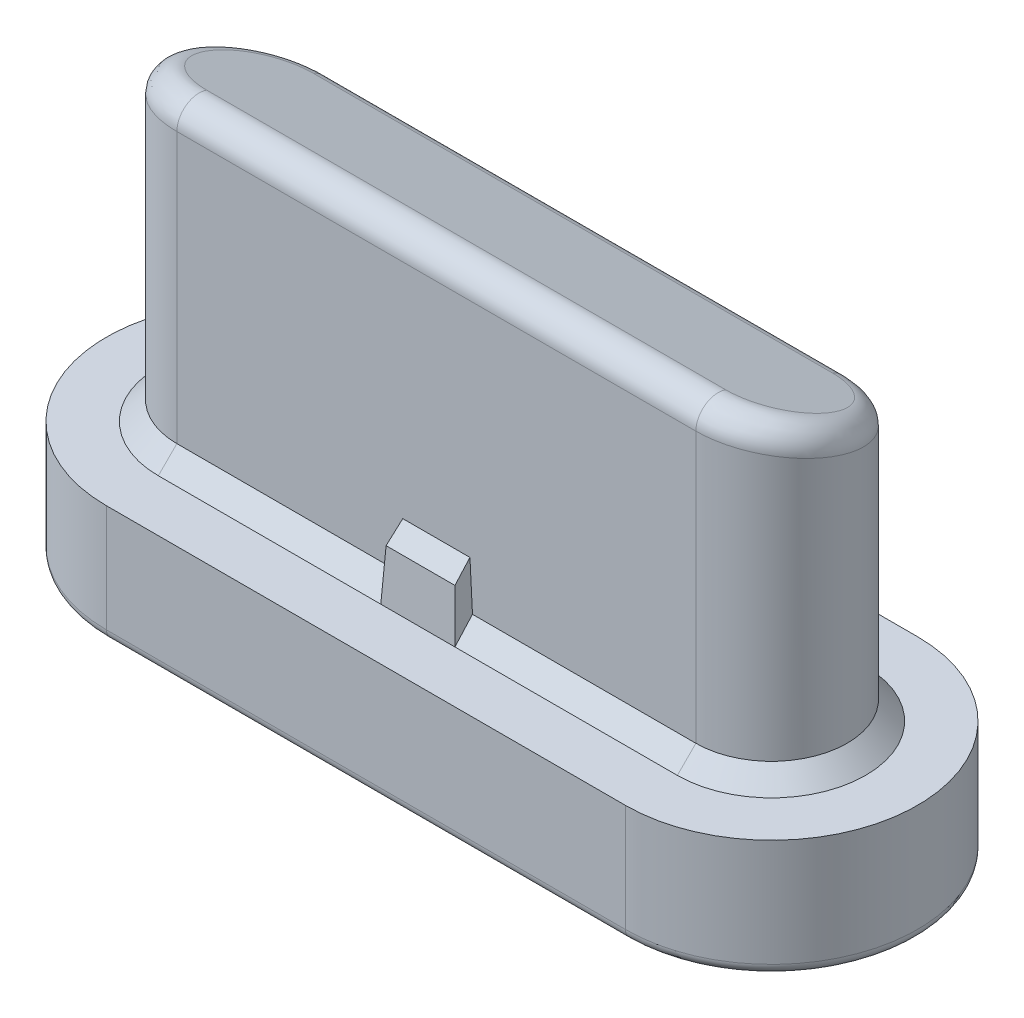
ISO-10303-21;
HEADER;
FILE_DESCRIPTION(('STEP AP214'),'2;1');
FILE_NAME('part.step','',(''),(''),'','','');
FILE_SCHEMA(('AUTOMOTIVE_DESIGN { 1 0 10303 214 1 1 1 1 }'));
ENDSEC;
DATA;
#1=APPLICATION_CONTEXT('core data for automotive mechanical design processes');
#2=APPLICATION_PROTOCOL_DEFINITION('international standard','automotive_design',2000,#1);
#3=PRODUCT_CONTEXT('',#1,'mechanical');
#4=PRODUCT('Part','Part','',(#3));
#5=PRODUCT_RELATED_PRODUCT_CATEGORY('part','',(#4));
#6=PRODUCT_DEFINITION_FORMATION('','',#4);
#7=PRODUCT_DEFINITION_CONTEXT('part definition',#1,'design');
#8=PRODUCT_DEFINITION('design','',#6,#7);
#9=PRODUCT_DEFINITION_SHAPE('','',#8);
#10=(LENGTH_UNIT() NAMED_UNIT(*) SI_UNIT(.MILLI.,.METRE.));
#11=(NAMED_UNIT(*) PLANE_ANGLE_UNIT() SI_UNIT($,.RADIAN.));
#12=(NAMED_UNIT(*) SI_UNIT($,.STERADIAN.) SOLID_ANGLE_UNIT());
#13=UNCERTAINTY_MEASURE_WITH_UNIT(LENGTH_MEASURE(1.E-05),#10,'distance_accuracy_value','');
#14=(GEOMETRIC_REPRESENTATION_CONTEXT(3) GLOBAL_UNCERTAINTY_ASSIGNED_CONTEXT((#13)) GLOBAL_UNIT_ASSIGNED_CONTEXT((#10,
#11,#12)) REPRESENTATION_CONTEXT('',''));
#15=CARTESIAN_POINT('',(0.,0.,0.));
#16=DIRECTION('',(0.,0.,1.));
#17=DIRECTION('',(1.,0.,0.));
#18=AXIS2_PLACEMENT_3D('',#15,#16,#17);
#19=CARTESIAN_POINT('',(7.46,-15.35,5.47));
#20=DIRECTION('',(0.,0.,1.));
#21=DIRECTION('',(1.,0.,0.));
#22=AXIS2_PLACEMENT_3D('',#19,#20,#21);
#23=PLANE('',#22);
#24=DIRECTION('',(0.,-1.,0.));
#25=VECTOR('',#24,1.);
#26=CARTESIAN_POINT('',(7.46,-15.35,5.47));
#27=LINE('',#26,#25);
#28=CARTESIAN_POINT('',(7.46,-14.5541436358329,5.47));
#29=VERTEX_POINT('',#28);
#30=CARTESIAN_POINT('',(7.46,-18.2,5.46999999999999));
#31=VERTEX_POINT('',#30);
#32=EDGE_CURVE('E274',#29,#31,#27,.T.);
#33=ORIENTED_EDGE('',*,*,#32,.F.);
#34=DIRECTION('',(-1.,0.,0.));
#35=VECTOR('',#34,1.);
#36=CARTESIAN_POINT('',(0.460000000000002,-14.5541436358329,5.47));
#37=LINE('',#36,#35);
#38=CARTESIAN_POINT('',(0.460000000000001,-14.5541436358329,5.47));
#39=VERTEX_POINT('',#38);
#40=EDGE_CURVE('E302',#29,#39,#37,.T.);
#41=ORIENTED_EDGE('',*,*,#40,.T.);
#42=DIRECTION('',(0.,1.,0.));
#43=VECTOR('',#42,1.);
#44=CARTESIAN_POINT('',(0.460000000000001,-15.3500000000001,5.47));
#45=LINE('',#44,#43);
#46=CARTESIAN_POINT('',(0.46,-18.2000000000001,5.47));
#47=VERTEX_POINT('',#46);
#48=EDGE_CURVE('E286',#39,#47,#45,.F.);
#49=ORIENTED_EDGE('',*,*,#48,.T.);
#50=DIRECTION('',(1.,0.,0.));
#51=VECTOR('',#50,1.);
#52=CARTESIAN_POINT('',(7.46,-18.2,5.46999999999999));
#53=LINE('',#52,#51);
#54=CARTESIAN_POINT('',(3.47310194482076,-18.2,5.47));
#55=VERTEX_POINT('',#54);
#56=EDGE_CURVE('E256',#47,#55,#53,.T.);
#57=ORIENTED_EDGE('',*,*,#56,.T.);
#58=DIRECTION('',(-0.0523359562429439,-0.998629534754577,0.));
#59=VECTOR('',#58,1.);
#60=CARTESIAN_POINT('',(3.63297532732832,-15.1494341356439,5.47));
#61=LINE('',#60,#59);
#62=CARTESIAN_POINT('',(3.50704081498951,-17.5524077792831,5.47));
#63=VERTEX_POINT('',#62);
#64=EDGE_CURVE('E300',#63,#55,#61,.T.);
#65=ORIENTED_EDGE('',*,*,#64,.F.);
#66=DIRECTION('',(1.,0.,0.));
#67=VECTOR('',#66,1.);
#68=CARTESIAN_POINT('',(4.46,-17.5524077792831,5.47));
#69=LINE('',#68,#67);
#70=CARTESIAN_POINT('',(4.41295918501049,-17.5524077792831,5.47));
#71=VERTEX_POINT('',#70);
#72=EDGE_CURVE('E282',#63,#71,#69,.T.);
#73=ORIENTED_EDGE('',*,*,#72,.T.);
#74=DIRECTION('',(-0.052335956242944,0.998629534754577,0.));
#75=VECTOR('',#74,1.);
#76=CARTESIAN_POINT('',(4.30619803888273,-15.5152837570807,5.47));
#77=LINE('',#76,#75);
#78=CARTESIAN_POINT('',(4.44689805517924,-18.2000000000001,5.47));
#79=VERTEX_POINT('',#78);
#80=EDGE_CURVE('E266',#71,#79,#77,.F.);
#81=ORIENTED_EDGE('',*,*,#80,.T.);
#82=DIRECTION('',(1.,0.,0.));
#83=VECTOR('',#82,1.);
#84=CARTESIAN_POINT('',(7.46,-18.2,5.46999999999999));
#85=LINE('',#84,#83);
#86=EDGE_CURVE('E245',#79,#31,#85,.T.);
#87=ORIENTED_EDGE('',*,*,#86,.T.);
#88=EDGE_LOOP('',(#33,#41,#49,#57,#65,#73,#81,#87));
#89=FACE_BOUND('',#88,.T.);
#90=ADVANCED_FACE('F90',(#89),#23,.T.);
#91=CARTESIAN_POINT('',(7.46,-18.4500000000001,5.72));
#92=DIRECTION('',(0.,-0.707106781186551,-0.707106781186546));
#93=DIRECTION('',(-1.,0.,0.));
#94=AXIS2_PLACEMENT_3D('',#91,#92,#93);
#95=PLANE('',#94);
#96=DIRECTION('',(0.0370324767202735,-0.706621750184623,0.706621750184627));
#97=VECTOR('',#96,1.);
#98=CARTESIAN_POINT('',(4.46411421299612,-18.5285038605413,5.79850386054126));
#99=LINE('',#98,#97);
#100=CARTESIAN_POINT('',(4.46,-18.45,5.72));
#101=VERTEX_POINT('',#100);
#102=EDGE_CURVE('E221',#101,#79,#99,.F.);
#103=ORIENTED_EDGE('',*,*,#102,.F.);
#104=DIRECTION('',(-1.,0.,0.));
#105=VECTOR('',#104,1.);
#106=CARTESIAN_POINT('',(7.46,-18.4500000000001,5.72));
#107=LINE('',#106,#105);
#108=CARTESIAN_POINT('',(7.46,-18.4500000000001,5.72));
#109=VERTEX_POINT('',#108);
#110=EDGE_CURVE('E243',#109,#101,#107,.T.);
#111=ORIENTED_EDGE('',*,*,#110,.F.);
#112=DIRECTION('',(0.,0.707106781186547,-0.70710678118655));
#113=VECTOR('',#112,1.);
#114=CARTESIAN_POINT('',(7.46,-18.4500000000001,5.72));
#115=LINE('',#114,#113);
#116=EDGE_CURVE('E265',#109,#31,#115,.T.);
#117=ORIENTED_EDGE('',*,*,#116,.T.);
#118=ORIENTED_EDGE('',*,*,#86,.F.);
#119=EDGE_LOOP('',(#103,#111,#117,#118));
#120=FACE_BOUND('',#119,.T.);
#121=ADVANCED_FACE('F241',(#120),#95,.F.);
#122=CARTESIAN_POINT('',(0.,-20.05,0.));
#123=DIRECTION('',(0.,-1.,0.));
#124=DIRECTION('',(0.,0.,-1.));
#125=AXIS2_PLACEMENT_3D('',#122,#123,#124);
#126=PLANE('',#125);
#127=DIRECTION('',(-1.,0.,0.));
#128=VECTOR('',#127,1.);
#129=CARTESIAN_POINT('',(0.,-20.0500000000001,2.63));
#130=LINE('',#129,#128);
#131=CARTESIAN_POINT('',(0.46,-20.0500000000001,2.63));
#132=VERTEX_POINT('',#131);
#133=CARTESIAN_POINT('',(7.46,-20.0500000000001,2.63));
#134=VERTEX_POINT('',#133);
#135=EDGE_CURVE('E438',#132,#134,#130,.F.);
#136=ORIENTED_EDGE('',*,*,#135,.T.);
#137=CARTESIAN_POINT('',(7.46000000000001,-20.05,4.44999999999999));
#138=DIRECTION('',(0.,-1.,0.));
#139=DIRECTION('',(0.,0.,-1.));
#140=AXIS2_PLACEMENT_3D('',#137,#138,#139);
#141=CIRCLE('',#140,1.82);
#142=CARTESIAN_POINT('',(7.46,-20.05,6.27));
#143=VERTEX_POINT('',#142);
#144=EDGE_CURVE('E440',#134,#143,#141,.T.);
#145=ORIENTED_EDGE('',*,*,#144,.T.);
#146=DIRECTION('',(1.,0.,0.));
#147=VECTOR('',#146,1.);
#148=CARTESIAN_POINT('',(0.,-20.0500000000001,6.27));
#149=LINE('',#148,#147);
#150=CARTESIAN_POINT('',(0.46,-20.0500000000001,6.27));
#151=VERTEX_POINT('',#150);
#152=EDGE_CURVE('E434',#143,#151,#149,.F.);
#153=ORIENTED_EDGE('',*,*,#152,.T.);
#154=CARTESIAN_POINT('',(0.46,-20.0500000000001,4.45));
#155=DIRECTION('',(0.,-1.,0.));
#156=DIRECTION('',(0.,0.,-1.));
#157=AXIS2_PLACEMENT_3D('',#154,#155,#156);
#158=CIRCLE('',#157,1.82);
#159=EDGE_CURVE('E436',#151,#132,#158,.T.);
#160=ORIENTED_EDGE('',*,*,#159,.T.);
#161=EDGE_LOOP('',(#136,#145,#153,#160));
#162=FACE_BOUND('',#161,.T.);
#163=ADVANCED_FACE('F369',(#162),#126,.T.);
#164=CARTESIAN_POINT('',(-1.54,-21.1500000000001,6.42));
#165=DIRECTION('',(0.,0.,1.));
#166=DIRECTION('',(1.,0.,0.));
#167=AXIS2_PLACEMENT_3D('',#164,#165,#166);
#168=PLANE('',#167);
#169=DIRECTION('',(0.,1.,0.));
#170=VECTOR('',#169,1.);
#171=CARTESIAN_POINT('',(0.46,-21.1500000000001,6.42));
#172=LINE('',#171,#170);
#173=CARTESIAN_POINT('',(0.46,-18.4500000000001,6.42));
#174=VERTEX_POINT('',#173);
#175=CARTESIAN_POINT('',(0.46,-19.9,6.42));
#176=VERTEX_POINT('',#175);
#177=EDGE_CURVE('E417',#174,#176,#172,.F.);
#178=ORIENTED_EDGE('',*,*,#177,.T.);
#179=DIRECTION('',(1.,0.,0.));
#180=VECTOR('',#179,1.);
#181=CARTESIAN_POINT('',(-1.54,-19.9000000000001,6.42));
#182=LINE('',#181,#180);
#183=CARTESIAN_POINT('',(7.46,-19.9,6.42));
#184=VERTEX_POINT('',#183);
#185=EDGE_CURVE('E447',#176,#184,#182,.T.);
#186=ORIENTED_EDGE('',*,*,#185,.T.);
#187=DIRECTION('',(0.,1.,0.));
#188=VECTOR('',#187,1.);
#189=CARTESIAN_POINT('',(7.46,-21.1500000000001,6.42));
#190=LINE('',#189,#188);
#191=CARTESIAN_POINT('',(7.46,-18.4500000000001,6.42));
#192=VERTEX_POINT('',#191);
#193=EDGE_CURVE('E420',#184,#192,#190,.T.);
#194=ORIENTED_EDGE('',*,*,#193,.T.);
#195=DIRECTION('',(1.,0.,0.));
#196=VECTOR('',#195,1.);
#197=CARTESIAN_POINT('',(-1.54,-18.45,6.42));
#198=LINE('',#197,#196);
#199=EDGE_CURVE('E421',#174,#192,#198,.T.);
#200=ORIENTED_EDGE('',*,*,#199,.F.);
#201=EDGE_LOOP('',(#178,#186,#194,#200));
#202=FACE_BOUND('',#201,.T.);
#203=ADVANCED_FACE('F499',(#202),#168,.T.);
#204=CARTESIAN_POINT('',(0.46,-11.5,4.45));
#205=DIRECTION('',(0.,1.,0.));
#206=DIRECTION('',(0.,0.,1.));
#207=AXIS2_PLACEMENT_3D('',#204,#205,#206);
#208=CYLINDRICAL_SURFACE('',#207,1.97);
#209=DIRECTION('',(0.,1.,0.));
#210=VECTOR('',#209,1.);
#211=CARTESIAN_POINT('',(0.46,-21.1500000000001,2.48));
#212=LINE('',#211,#210);
#213=CARTESIAN_POINT('',(0.46,-19.9,2.48));
#214=VERTEX_POINT('',#213);
#215=CARTESIAN_POINT('',(0.46,-18.4500000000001,2.48));
#216=VERTEX_POINT('',#215);
#217=EDGE_CURVE('E428',#214,#216,#212,.T.);
#218=ORIENTED_EDGE('',*,*,#217,.F.);
#219=CARTESIAN_POINT('',(0.46,-19.9,4.45));
#220=DIRECTION('',(0.,-1.,0.));
#221=DIRECTION('',(0.,0.,-1.));
#222=AXIS2_PLACEMENT_3D('',#219,#220,#221);
#223=CIRCLE('',#222,1.97);
#224=EDGE_CURVE('E445',#214,#176,#223,.F.);
#225=ORIENTED_EDGE('',*,*,#224,.T.);
#226=ORIENTED_EDGE('',*,*,#177,.F.);
#227=CARTESIAN_POINT('',(0.46,-18.4500000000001,4.45));
#228=DIRECTION('',(0.,-1.,0.));
#229=DIRECTION('',(0.,0.,-1.));
#230=AXIS2_PLACEMENT_3D('',#227,#228,#229);
#231=CIRCLE('',#230,1.97);
#232=EDGE_CURVE('E458',#216,#174,#231,.F.);
#233=ORIENTED_EDGE('',*,*,#232,.F.);
#234=EDGE_LOOP('',(#218,#225,#226,#233));
#235=FACE_BOUND('',#234,.T.);
#236=ADVANCED_FACE('F489',(#235),#208,.T.);
#237=CARTESIAN_POINT('',(7.46,-21.1500000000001,4.45));
#238=DIRECTION('',(0.,1.,0.));
#239=DIRECTION('',(0.,0.,1.));
#240=AXIS2_PLACEMENT_3D('',#237,#238,#239);
#241=CYLINDRICAL_SURFACE('',#240,1.97);
#242=ORIENTED_EDGE('',*,*,#193,.F.);
#243=CARTESIAN_POINT('',(7.46000000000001,-19.9,4.45));
#244=DIRECTION('',(0.,-1.,0.));
#245=DIRECTION('',(0.,0.,-1.));
#246=AXIS2_PLACEMENT_3D('',#243,#244,#245);
#247=CIRCLE('',#246,1.97);
#248=CARTESIAN_POINT('',(7.46,-19.9000000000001,2.48));
#249=VERTEX_POINT('',#248);
#250=EDGE_CURVE('E431',#184,#249,#247,.F.);
#251=ORIENTED_EDGE('',*,*,#250,.T.);
#252=DIRECTION('',(0.,1.,0.));
#253=VECTOR('',#252,1.);
#254=CARTESIAN_POINT('',(7.46000000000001,-21.1500000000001,2.48));
#255=LINE('',#254,#253);
#256=CARTESIAN_POINT('',(7.46,-18.45,2.48));
#257=VERTEX_POINT('',#256);
#258=EDGE_CURVE('E425',#257,#249,#255,.F.);
#259=ORIENTED_EDGE('',*,*,#258,.F.);
#260=CARTESIAN_POINT('',(7.46,-18.4500000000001,4.45));
#261=DIRECTION('',(0.,-1.,0.));
#262=DIRECTION('',(0.,0.,-1.));
#263=AXIS2_PLACEMENT_3D('',#260,#261,#262);
#264=CIRCLE('',#263,1.97);
#265=EDGE_CURVE('E460',#192,#257,#264,.F.);
#266=ORIENTED_EDGE('',*,*,#265,.F.);
#267=EDGE_LOOP('',(#242,#251,#259,#266));
#268=FACE_BOUND('',#267,.T.);
#269=ADVANCED_FACE('F474',(#268),#241,.T.);
#270=CARTESIAN_POINT('',(-1.54,-21.1500000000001,2.48));
#271=DIRECTION('',(0.,0.,-1.));
#272=DIRECTION('',(-1.,0.,0.));
#273=AXIS2_PLACEMENT_3D('',#270,#271,#272);
#274=PLANE('',#273);
#275=ORIENTED_EDGE('',*,*,#258,.T.);
#276=DIRECTION('',(-1.,0.,0.));
#277=VECTOR('',#276,1.);
#278=CARTESIAN_POINT('',(-1.54,-19.9000000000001,2.48));
#279=LINE('',#278,#277);
#280=EDGE_CURVE('E443',#249,#214,#279,.T.);
#281=ORIENTED_EDGE('',*,*,#280,.T.);
#282=ORIENTED_EDGE('',*,*,#217,.T.);
#283=DIRECTION('',(-1.,0.,0.));
#284=VECTOR('',#283,1.);
#285=CARTESIAN_POINT('',(-1.54,-18.45,2.48));
#286=LINE('',#285,#284);
#287=EDGE_CURVE('E424',#257,#216,#286,.T.);
#288=ORIENTED_EDGE('',*,*,#287,.F.);
#289=EDGE_LOOP('',(#275,#281,#282,#288));
#290=FACE_BOUND('',#289,.T.);
#291=ADVANCED_FACE('F471',(#290),#274,.T.);
#292=CARTESIAN_POINT('',(0.46,-19.9,4.45));
#293=DIRECTION('',(0.,-1.,0.));
#294=DIRECTION('',(0.,0.,-1.));
#295=AXIS2_PLACEMENT_3D('',#292,#293,#294);
#296=TOROIDAL_SURFACE('',#295,1.82,0.15);
#297=CARTESIAN_POINT('',(0.46,-19.9,2.63));
#298=DIRECTION('',(1.,0.,0.));
#299=DIRECTION('',(0.,0.,-1.));
#300=AXIS2_PLACEMENT_3D('',#297,#298,#299);
#301=CIRCLE('',#300,0.15);
#302=EDGE_CURVE('E452',#132,#214,#301,.T.);
#303=ORIENTED_EDGE('',*,*,#302,.F.);
#304=ORIENTED_EDGE('',*,*,#159,.F.);
#305=CARTESIAN_POINT('',(0.46,-19.9000000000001,6.27));
#306=DIRECTION('',(1.,0.,0.));
#307=DIRECTION('',(0.,0.,-1.));
#308=AXIS2_PLACEMENT_3D('',#305,#306,#307);
#309=CIRCLE('',#308,0.15);
#310=EDGE_CURVE('E455',#176,#151,#309,.T.);
#311=ORIENTED_EDGE('',*,*,#310,.F.);
#312=ORIENTED_EDGE('',*,*,#224,.F.);
#313=EDGE_LOOP('',(#303,#304,#311,#312));
#314=FACE_BOUND('',#313,.T.);
#315=ADVANCED_FACE('F493',(#314),#296,.T.);
#316=CARTESIAN_POINT('',(-1.54,-19.9000000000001,6.27));
#317=DIRECTION('',(1.,0.,0.));
#318=DIRECTION('',(0.,0.,-1.));
#319=AXIS2_PLACEMENT_3D('',#316,#317,#318);
#320=CYLINDRICAL_SURFACE('',#319,0.15);
#321=ORIENTED_EDGE('',*,*,#310,.T.);
#322=ORIENTED_EDGE('',*,*,#152,.F.);
#323=CARTESIAN_POINT('',(7.46,-19.9000000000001,6.27));
#324=DIRECTION('',(1.,0.,0.));
#325=DIRECTION('',(0.,0.,-1.));
#326=AXIS2_PLACEMENT_3D('',#323,#324,#325);
#327=CIRCLE('',#326,0.15);
#328=EDGE_CURVE('E450',#184,#143,#327,.T.);
#329=ORIENTED_EDGE('',*,*,#328,.F.);
#330=ORIENTED_EDGE('',*,*,#185,.F.);
#331=EDGE_LOOP('',(#321,#322,#329,#330));
#332=FACE_BOUND('',#331,.T.);
#333=ADVANCED_FACE('F497',(#332),#320,.T.);
#334=CARTESIAN_POINT('',(-1.54,-19.9000000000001,2.63));
#335=DIRECTION('',(-1.,0.,0.));
#336=DIRECTION('',(0.,0.,1.));
#337=AXIS2_PLACEMENT_3D('',#334,#335,#336);
#338=CYLINDRICAL_SURFACE('',#337,0.15);
#339=ORIENTED_EDGE('',*,*,#302,.T.);
#340=ORIENTED_EDGE('',*,*,#280,.F.);
#341=CARTESIAN_POINT('',(7.46,-19.9000000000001,2.63));
#342=DIRECTION('',(1.,0.,0.));
#343=DIRECTION('',(0.,0.,-1.));
#344=AXIS2_PLACEMENT_3D('',#341,#342,#343);
#345=CIRCLE('',#344,0.15);
#346=EDGE_CURVE('E289',#134,#249,#345,.T.);
#347=ORIENTED_EDGE('',*,*,#346,.F.);
#348=ORIENTED_EDGE('',*,*,#135,.F.);
#349=EDGE_LOOP('',(#339,#340,#347,#348));
#350=FACE_BOUND('',#349,.T.);
#351=ADVANCED_FACE('F485',(#350),#338,.T.);
#352=CARTESIAN_POINT('',(7.46000000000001,-19.9,4.45));
#353=DIRECTION('',(0.,-1.,0.));
#354=DIRECTION('',(0.,0.,-1.));
#355=AXIS2_PLACEMENT_3D('',#352,#353,#354);
#356=TOROIDAL_SURFACE('',#355,1.82,0.15);
#357=ORIENTED_EDGE('',*,*,#328,.T.);
#358=ORIENTED_EDGE('',*,*,#144,.F.);
#359=ORIENTED_EDGE('',*,*,#346,.T.);
#360=ORIENTED_EDGE('',*,*,#250,.F.);
#361=EDGE_LOOP('',(#357,#358,#359,#360));
#362=FACE_BOUND('',#361,.T.);
#363=ADVANCED_FACE('F478',(#362),#356,.T.);
#364=CARTESIAN_POINT('',(7.46,-18.4500000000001,4.45));
#365=DIRECTION('',(0.,-1.,0.));
#366=DIRECTION('',(0.,0.,-1.));
#367=AXIS2_PLACEMENT_3D('',#364,#365,#366);
#368=PLANE('',#367);
#369=CARTESIAN_POINT('',(7.46,-18.4500000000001,4.45));
#370=DIRECTION('',(0.,-1.,0.));
#371=DIRECTION('',(0.,0.,-1.));
#372=AXIS2_PLACEMENT_3D('',#369,#370,#371);
#373=CIRCLE('',#372,1.27);
#374=CARTESIAN_POINT('',(7.46,-18.4500000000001,3.17999999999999));
#375=VERTEX_POINT('',#374);
#376=EDGE_CURVE('E252',#375,#109,#373,.T.);
#377=ORIENTED_EDGE('',*,*,#376,.T.);
#378=ORIENTED_EDGE('',*,*,#110,.T.);
#379=DIRECTION('',(-1.,0.,0.));
#380=VECTOR('',#379,1.);
#381=CARTESIAN_POINT('',(4.46,-18.45,5.72));
#382=LINE('',#381,#380);
#383=CARTESIAN_POINT('',(3.46,-18.4500000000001,5.72));
#384=VERTEX_POINT('',#383);
#385=EDGE_CURVE('E229',#101,#384,#382,.T.);
#386=ORIENTED_EDGE('',*,*,#385,.T.);
#387=CARTESIAN_POINT('',(0.460000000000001,-18.45,5.72));
#388=VERTEX_POINT('',#387);
#389=EDGE_CURVE('E254',#384,#388,#107,.T.);
#390=ORIENTED_EDGE('',*,*,#389,.T.);
#391=CARTESIAN_POINT('',(0.46,-18.4500000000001,4.45));
#392=DIRECTION('',(0.,-1.,0.));
#393=DIRECTION('',(0.,0.,-1.));
#394=AXIS2_PLACEMENT_3D('',#391,#392,#393);
#395=CIRCLE('',#394,1.27);
#396=CARTESIAN_POINT('',(0.46,-18.4500000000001,3.17999999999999));
#397=VERTEX_POINT('',#396);
#398=EDGE_CURVE('E258',#388,#397,#395,.T.);
#399=ORIENTED_EDGE('',*,*,#398,.T.);
#400=DIRECTION('',(1.,0.,0.));
#401=VECTOR('',#400,1.);
#402=CARTESIAN_POINT('',(7.46,-18.4500000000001,3.17999999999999));
#403=LINE('',#402,#401);
#404=EDGE_CURVE('E404',#397,#375,#403,.T.);
#405=ORIENTED_EDGE('',*,*,#404,.T.);
#406=EDGE_LOOP('',(#377,#378,#386,#390,#399,#405));
#407=FACE_BOUND('',#406,.T.);
#408=ORIENTED_EDGE('',*,*,#199,.T.);
#409=ORIENTED_EDGE('',*,*,#265,.T.);
#410=ORIENTED_EDGE('',*,*,#287,.T.);
#411=ORIENTED_EDGE('',*,*,#232,.T.);
#412=EDGE_LOOP('',(#408,#409,#410,#411));
#413=FACE_BOUND('',#412,.T.);
#414=ADVANCED_FACE('F249',(#407,#413),#368,.F.);
#415=CARTESIAN_POINT('',(7.46,-15.35,4.45));
#416=DIRECTION('',(0.,-1.,0.));
#417=DIRECTION('',(0.,0.,-1.));
#418=AXIS2_PLACEMENT_3D('',#415,#416,#417);
#419=CYLINDRICAL_SURFACE('',#418,1.02);
#420=DIRECTION('',(0.,1.,0.));
#421=VECTOR('',#420,1.);
#422=CARTESIAN_POINT('',(7.46000000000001,-15.35,3.43));
#423=LINE('',#422,#421);
#424=CARTESIAN_POINT('',(7.46,-15.0782607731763,3.43));
#425=VERTEX_POINT('',#424);
#426=CARTESIAN_POINT('',(7.46,-18.2,3.43));
#427=VERTEX_POINT('',#426);
#428=EDGE_CURVE('E285',#425,#427,#423,.F.);
#429=ORIENTED_EDGE('',*,*,#428,.F.);
#430=CARTESIAN_POINT('',(7.46,-14.8162022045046,4.45));
#431=DIRECTION('',(0.,0.968544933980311,-0.248838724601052));
#432=DIRECTION('',(0.,-0.248838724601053,-0.96854493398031));
#433=AXIS2_PLACEMENT_3D('',#430,#431,#432);
#434=ELLIPSE('',#433,1.05312615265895,1.02);
#435=EDGE_CURVE('E15',#425,#29,#434,.F.);
#436=ORIENTED_EDGE('',*,*,#435,.T.);
#437=ORIENTED_EDGE('',*,*,#32,.T.);
#438=CARTESIAN_POINT('',(7.46,-18.2,4.44999999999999));
#439=DIRECTION('',(0.,-1.,0.));
#440=DIRECTION('',(0.,0.,-1.));
#441=AXIS2_PLACEMENT_3D('',#438,#439,#440);
#442=CIRCLE('',#441,1.02);
#443=EDGE_CURVE('E294',#31,#427,#442,.F.);
#444=ORIENTED_EDGE('',*,*,#443,.T.);
#445=EDGE_LOOP('',(#429,#436,#437,#444));
#446=FACE_BOUND('',#445,.T.);
#447=ADVANCED_FACE('F373',(#446),#419,.T.);
#448=CARTESIAN_POINT('',(0.46,-15.35,3.43));
#449=DIRECTION('',(0.,0.,-1.));
#450=DIRECTION('',(-1.,0.,0.));
#451=AXIS2_PLACEMENT_3D('',#448,#449,#450);
#452=PLANE('',#451);
#453=DIRECTION('',(0.,-1.,0.));
#454=VECTOR('',#453,1.);
#455=CARTESIAN_POINT('',(0.460000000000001,-15.35,3.43));
#456=LINE('',#455,#454);
#457=CARTESIAN_POINT('',(0.46,-15.0782607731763,3.43));
#458=VERTEX_POINT('',#457);
#459=CARTESIAN_POINT('',(0.46,-18.2000000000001,3.43));
#460=VERTEX_POINT('',#459);
#461=EDGE_CURVE('E283',#458,#460,#456,.T.);
#462=ORIENTED_EDGE('',*,*,#461,.F.);
#463=DIRECTION('',(1.,0.,0.));
#464=VECTOR('',#463,1.);
#465=CARTESIAN_POINT('',(7.46,-15.0782607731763,3.43));
#466=LINE('',#465,#464);
#467=EDGE_CURVE('E99',#458,#425,#466,.T.);
#468=ORIENTED_EDGE('',*,*,#467,.T.);
#469=ORIENTED_EDGE('',*,*,#428,.T.);
#470=DIRECTION('',(-1.,0.,0.));
#471=VECTOR('',#470,1.);
#472=CARTESIAN_POINT('',(0.46,-18.2000000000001,3.43));
#473=LINE('',#472,#471);
#474=EDGE_CURVE('E276',#427,#460,#473,.T.);
#475=ORIENTED_EDGE('',*,*,#474,.T.);
#476=EDGE_LOOP('',(#462,#468,#469,#475));
#477=FACE_BOUND('',#476,.T.);
#478=ADVANCED_FACE('F376',(#477),#452,.T.);
#479=CARTESIAN_POINT('',(0.46,-15.35,4.44999999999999));
#480=DIRECTION('',(0.,-1.,0.));
#481=DIRECTION('',(0.,0.,-1.));
#482=AXIS2_PLACEMENT_3D('',#479,#480,#481);
#483=CYLINDRICAL_SURFACE('',#482,1.02);
#484=ORIENTED_EDGE('',*,*,#48,.F.);
#485=CARTESIAN_POINT('',(0.46,-14.8162022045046,4.45));
#486=DIRECTION('',(0.,0.968544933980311,-0.248838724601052));
#487=DIRECTION('',(0.,-0.248838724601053,-0.96854493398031));
#488=AXIS2_PLACEMENT_3D('',#485,#486,#487);
#489=ELLIPSE('',#488,1.05312615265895,1.02);
#490=EDGE_CURVE('E114',#39,#458,#489,.F.);
#491=ORIENTED_EDGE('',*,*,#490,.T.);
#492=ORIENTED_EDGE('',*,*,#461,.T.);
#493=CARTESIAN_POINT('',(0.46,-18.2000000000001,4.45));
#494=DIRECTION('',(0.,-1.,0.));
#495=DIRECTION('',(0.,0.,-1.));
#496=AXIS2_PLACEMENT_3D('',#493,#494,#495);
#497=CIRCLE('',#496,1.02);
#498=EDGE_CURVE('E291',#460,#47,#497,.F.);
#499=ORIENTED_EDGE('',*,*,#498,.T.);
#500=EDGE_LOOP('',(#484,#491,#492,#499));
#501=FACE_BOUND('',#500,.T.);
#502=ADVANCED_FACE('F338',(#501),#483,.T.);
#503=CARTESIAN_POINT('',(0.,-16.0402300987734,0.209869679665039));
#504=DIRECTION('',(0.,-0.93969262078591,0.342020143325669));
#505=DIRECTION('',(0.,-0.342020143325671,-0.939692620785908));
#506=AXIS2_PLACEMENT_3D('',#503,#504,#505);
#507=PLANE('',#506);
#508=CARTESIAN_POINT('',(0.46,-14.5342944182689,4.3473939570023));
#509=DIRECTION('',(0.,-0.93969262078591,0.342020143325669));
#510=DIRECTION('',(0.,-0.342020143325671,-0.939692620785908));
#511=AXIS2_PLACEMENT_3D('',#508,#509,#510);
#512=ELLIPSE('',#511,0.766207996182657,0.72);
#513=CARTESIAN_POINT('',(0.46,-14.7963529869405,3.6273939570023));
#514=VERTEX_POINT('',#513);
#515=CARTESIAN_POINT('',(0.46,-14.2722358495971,5.0673939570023));
#516=VERTEX_POINT('',#515);
#517=EDGE_CURVE('E312',#514,#516,#512,.F.);
#518=ORIENTED_EDGE('',*,*,#517,.T.);
#519=DIRECTION('',(-1.,0.,0.));
#520=VECTOR('',#519,1.);
#521=CARTESIAN_POINT('',(7.46,-14.2722358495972,5.0673939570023));
#522=LINE('',#521,#520);
#523=CARTESIAN_POINT('',(7.46,-14.2722358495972,5.0673939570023));
#524=VERTEX_POINT('',#523);
#525=EDGE_CURVE('E314',#516,#524,#522,.F.);
#526=ORIENTED_EDGE('',*,*,#525,.T.);
#527=CARTESIAN_POINT('',(7.46000000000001,-14.5342944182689,4.3473939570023));
#528=DIRECTION('',(0.,-0.93969262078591,0.342020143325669));
#529=DIRECTION('',(0.,-0.342020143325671,-0.939692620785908));
#530=AXIS2_PLACEMENT_3D('',#527,#528,#529);
#531=ELLIPSE('',#530,0.766207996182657,0.72);
#532=CARTESIAN_POINT('',(7.46,-14.7963529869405,3.6273939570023));
#533=VERTEX_POINT('',#532);
#534=EDGE_CURVE('E308',#524,#533,#531,.F.);
#535=ORIENTED_EDGE('',*,*,#534,.T.);
#536=DIRECTION('',(1.,0.,0.));
#537=VECTOR('',#536,1.);
#538=CARTESIAN_POINT('',(0.46,-14.7963529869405,3.6273939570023));
#539=LINE('',#538,#537);
#540=EDGE_CURVE('E310',#533,#514,#539,.F.);
#541=ORIENTED_EDGE('',*,*,#540,.T.);
#542=EDGE_LOOP('',(#518,#526,#535,#541));
#543=FACE_BOUND('',#542,.T.);
#544=ADVANCED_FACE('F342',(#543),#507,.F.);
#545=CARTESIAN_POINT('',(7.46,-18.4500000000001,3.17999999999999));
#546=DIRECTION('',(0.,-0.707106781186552,0.707106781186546));
#547=DIRECTION('',(1.,0.,0.));
#548=AXIS2_PLACEMENT_3D('',#545,#546,#547);
#549=PLANE('',#548);
#550=DIRECTION('',(0.,-0.707106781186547,-0.70710678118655));
#551=VECTOR('',#550,1.);
#552=CARTESIAN_POINT('',(0.46,-18.1500000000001,3.48));
#553=LINE('',#552,#551);
#554=EDGE_CURVE('E268',#460,#397,#553,.T.);
#555=ORIENTED_EDGE('',*,*,#554,.F.);
#556=ORIENTED_EDGE('',*,*,#474,.F.);
#557=DIRECTION('',(0.,0.707106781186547,0.70710678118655));
#558=VECTOR('',#557,1.);
#559=CARTESIAN_POINT('',(7.46,-18.4500000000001,3.17999999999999));
#560=LINE('',#559,#558);
#561=EDGE_CURVE('E271',#375,#427,#560,.T.);
#562=ORIENTED_EDGE('',*,*,#561,.F.);
#563=ORIENTED_EDGE('',*,*,#404,.F.);
#564=EDGE_LOOP('',(#555,#556,#562,#563));
#565=FACE_BOUND('',#564,.T.);
#566=ADVANCED_FACE('F346',(#565),#549,.F.);
#567=CARTESIAN_POINT('',(7.46,-18.4500000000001,4.45));
#568=DIRECTION('',(0.,-1.,0.));
#569=DIRECTION('',(0.,0.,-1.));
#570=AXIS2_PLACEMENT_3D('',#567,#568,#569);
#571=CONICAL_SURFACE('',#570,1.27,0.785398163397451);
#572=ORIENTED_EDGE('',*,*,#561,.T.);
#573=ORIENTED_EDGE('',*,*,#443,.F.);
#574=ORIENTED_EDGE('',*,*,#116,.F.);
#575=ORIENTED_EDGE('',*,*,#376,.F.);
#576=EDGE_LOOP('',(#572,#573,#574,#575));
#577=FACE_BOUND('',#576,.T.);
#578=ADVANCED_FACE('F399',(#577),#571,.T.);
#579=CARTESIAN_POINT('',(0.46,-18.4500000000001,4.45));
#580=DIRECTION('',(0.,-1.,0.));
#581=DIRECTION('',(0.,0.,-1.));
#582=AXIS2_PLACEMENT_3D('',#579,#580,#581);
#583=CONICAL_SURFACE('',#582,1.27,0.785398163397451);
#584=ORIENTED_EDGE('',*,*,#554,.T.);
#585=ORIENTED_EDGE('',*,*,#398,.F.);
#586=DIRECTION('',(0.,-0.707106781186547,0.70710678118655));
#587=VECTOR('',#586,1.);
#588=CARTESIAN_POINT('',(0.460000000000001,-18.1500000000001,5.42));
#589=LINE('',#588,#587);
#590=EDGE_CURVE('E262',#47,#388,#589,.T.);
#591=ORIENTED_EDGE('',*,*,#590,.F.);
#592=ORIENTED_EDGE('',*,*,#498,.F.);
#593=EDGE_LOOP('',(#584,#585,#591,#592));
#594=FACE_BOUND('',#593,.T.);
#595=ADVANCED_FACE('F408',(#594),#583,.T.);
#596=ORIENTED_EDGE('',*,*,#389,.F.);
#597=DIRECTION('',(0.0370324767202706,0.706621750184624,-0.706621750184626));
#598=VECTOR('',#597,1.);
#599=CARTESIAN_POINT('',(3.46548561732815,-18.345328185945,5.61532818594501));
#600=LINE('',#599,#598);
#601=EDGE_CURVE('E247',#384,#55,#600,.T.);
#602=ORIENTED_EDGE('',*,*,#601,.T.);
#603=ORIENTED_EDGE('',*,*,#56,.F.);
#604=ORIENTED_EDGE('',*,*,#590,.T.);
#605=EDGE_LOOP('',(#596,#602,#603,#604));
#606=FACE_BOUND('',#605,.T.);
#607=ADVANCED_FACE('F371',(#606),#95,.F.);
#608=CARTESIAN_POINT('',(4.46,-18.45,5.72));
#609=DIRECTION('',(0.998629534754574,0.0523359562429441,0.));
#610=DIRECTION('',(-0.052335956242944,0.998629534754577,0.));
#611=AXIS2_PLACEMENT_3D('',#608,#609,#610);
#612=PLANE('',#611);
#613=ORIENTED_EDGE('',*,*,#80,.F.);
#614=DIRECTION('',(-0.0370324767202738,0.706621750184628,-0.706621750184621));
#615=VECTOR('',#614,1.);
#616=CARTESIAN_POINT('',(4.42423321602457,-17.7675291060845,5.68512132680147));
#617=LINE('',#616,#615);
#618=CARTESIAN_POINT('',(4.42418409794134,-17.7665918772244,5.68418409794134));
#619=VERTEX_POINT('',#618);
#620=EDGE_CURVE('E224',#71,#619,#617,.F.);
#621=ORIENTED_EDGE('',*,*,#620,.T.);
#622=DIRECTION('',(-0.0522644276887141,0.99726468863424,-0.0522644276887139));
#623=VECTOR('',#622,1.);
#624=CARTESIAN_POINT('',(4.46,-18.45,5.72));
#625=LINE('',#624,#623);
#626=EDGE_CURVE('E216',#619,#101,#625,.F.);
#627=ORIENTED_EDGE('',*,*,#626,.T.);
#628=ORIENTED_EDGE('',*,*,#102,.T.);
#629=EDGE_LOOP('',(#613,#621,#627,#628));
#630=FACE_BOUND('',#629,.T.);
#631=ADVANCED_FACE('F219',(#630),#612,.T.);
#632=CARTESIAN_POINT('',(3.46,-18.4500000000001,5.72));
#633=DIRECTION('',(-0.998629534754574,0.052335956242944,0.));
#634=DIRECTION('',(-0.0523359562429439,-0.998629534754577,0.));
#635=AXIS2_PLACEMENT_3D('',#632,#633,#634);
#636=PLANE('',#635);
#637=DIRECTION('',(-0.052264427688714,-0.99726468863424,0.0522644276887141));
#638=VECTOR('',#637,1.);
#639=CARTESIAN_POINT('',(3.46273157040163,-18.3978785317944,5.71726842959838));
#640=LINE('',#639,#638);
#641=CARTESIAN_POINT('',(3.49581590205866,-17.7665918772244,5.68418409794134));
#642=VERTEX_POINT('',#641);
#643=EDGE_CURVE('E228',#642,#384,#640,.T.);
#644=ORIENTED_EDGE('',*,*,#643,.F.);
#645=DIRECTION('',(0.0370324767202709,0.706621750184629,-0.706621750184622));
#646=VECTOR('',#645,1.);
#647=CARTESIAN_POINT('',(3.47694616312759,-18.12664794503,6.04424016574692));
#648=LINE('',#647,#646);
#649=EDGE_CURVE('E279',#642,#63,#648,.T.);
#650=ORIENTED_EDGE('',*,*,#649,.T.);
#651=ORIENTED_EDGE('',*,*,#64,.T.);
#652=ORIENTED_EDGE('',*,*,#601,.F.);
#653=EDGE_LOOP('',(#644,#650,#651,#652));
#654=FACE_BOUND('',#653,.T.);
#655=ADVANCED_FACE('F362',(#654),#636,.T.);
#656=CARTESIAN_POINT('',(4.46,-18.45,5.72));
#657=DIRECTION('',(0.,0.0523359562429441,0.998629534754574));
#658=DIRECTION('',(0.,-0.998629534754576,0.0523359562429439));
#659=AXIS2_PLACEMENT_3D('',#656,#657,#658);
#660=PLANE('',#659);
#661=ORIENTED_EDGE('',*,*,#626,.F.);
#662=DIRECTION('',(-1.,0.,0.));
#663=VECTOR('',#662,1.);
#664=CARTESIAN_POINT('',(3.51240777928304,-17.7665918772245,5.68418409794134));
#665=LINE('',#664,#663);
#666=EDGE_CURVE('E246',#619,#642,#665,.T.);
#667=ORIENTED_EDGE('',*,*,#666,.T.);
#668=ORIENTED_EDGE('',*,*,#643,.T.);
#669=ORIENTED_EDGE('',*,*,#385,.F.);
#670=EDGE_LOOP('',(#661,#667,#668,#669));
#671=FACE_BOUND('',#670,.T.);
#672=ADVANCED_FACE('F232',(#671),#660,.T.);
#673=CARTESIAN_POINT('',(4.46,-17.7665918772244,5.68418409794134));
#674=DIRECTION('',(0.,0.707106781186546,0.707106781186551));
#675=DIRECTION('',(1.,0.,0.));
#676=AXIS2_PLACEMENT_3D('',#673,#674,#675);
#677=PLANE('',#676);
#678=ORIENTED_EDGE('',*,*,#620,.F.);
#679=ORIENTED_EDGE('',*,*,#72,.F.);
#680=ORIENTED_EDGE('',*,*,#649,.F.);
#681=ORIENTED_EDGE('',*,*,#666,.F.);
#682=EDGE_LOOP('',(#678,#679,#680,#681));
#683=FACE_BOUND('',#682,.T.);
#684=ADVANCED_FACE('F351',(#683),#677,.T.);
#685=CARTESIAN_POINT('',(0.46,-15.0782607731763,3.73));
#686=DIRECTION('',(-1.,0.,0.));
#687=DIRECTION('',(0.,0.,1.));
#688=AXIS2_PLACEMENT_3D('',#685,#686,#687);
#689=CYLINDRICAL_SURFACE('',#688,0.3);
#690=CARTESIAN_POINT('',(0.46,-15.0782607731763,3.73));
#691=DIRECTION('',(-1.,0.,0.));
#692=DIRECTION('',(0.,0.,1.));
#693=AXIS2_PLACEMENT_3D('',#690,#691,#692);
#694=CIRCLE('',#693,0.3);
#695=EDGE_CURVE('E323',#514,#458,#694,.T.);
#696=ORIENTED_EDGE('',*,*,#695,.F.);
#697=ORIENTED_EDGE('',*,*,#540,.F.);
#698=CARTESIAN_POINT('',(7.46,-15.0782607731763,3.73));
#699=DIRECTION('',(1.,0.,0.));
#700=DIRECTION('',(0.,0.,-1.));
#701=AXIS2_PLACEMENT_3D('',#698,#699,#700);
#702=CIRCLE('',#701,0.3);
#703=EDGE_CURVE('E237',#425,#533,#702,.T.);
#704=ORIENTED_EDGE('',*,*,#703,.F.);
#705=ORIENTED_EDGE('',*,*,#467,.F.);
#706=EDGE_LOOP('',(#696,#697,#704,#705));
#707=FACE_BOUND('',#706,.T.);
#708=ADVANCED_FACE('F92',(#707),#689,.T.);
#709=CARTESIAN_POINT('',(7.46,-14.7963529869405,3.62739395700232));
#710=CARTESIAN_POINT('',(7.46,-14.8681985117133,3.43));
#711=CARTESIAN_POINT('',(7.46,-15.0782607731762,3.43));
#712=CARTESIAN_POINT('',(7.49142764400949,-14.7963529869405,3.62739395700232));
#713=CARTESIAN_POINT('',(7.50118512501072,-14.8681985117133,3.43));
#714=CARTESIAN_POINT('',(7.50452249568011,-15.0782607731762,3.43));
#715=CARTESIAN_POINT('',(7.52285528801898,-14.7956023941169,3.6294561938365));
#716=CARTESIAN_POINT('',(7.54240030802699,-14.8672935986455,3.43248622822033));
#717=CARTESIAN_POINT('',(7.54904499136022,-15.0775101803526,3.43292150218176));
#718=CARTESIAN_POINT('',(7.58517195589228,-14.7926163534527,3.63766027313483));
#719=CARTESIAN_POINT('',(7.62419227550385,-14.8636948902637,3.4423735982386));
#720=CARTESIAN_POINT('',(7.63732693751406,-15.0745241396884,3.44454394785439));
#721=CARTESIAN_POINT('',(7.61605961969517,-14.7903775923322,3.64381121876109));
#722=CARTESIAN_POINT('',(7.66482574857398,-14.8609918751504,3.44980007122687));
#723=CARTESIAN_POINT('',(7.68108446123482,-15.0722853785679,3.45325778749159));
#724=CARTESIAN_POINT('',(7.67676980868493,-14.7844568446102,3.66007833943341));
#725=CARTESIAN_POINT('',(7.74488972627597,-14.8538402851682,3.46944890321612));
#726=CARTESIAN_POINT('',(7.76709056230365,-15.0663646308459,3.47630287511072));
#727=CARTESIAN_POINT('',(7.70658719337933,-14.7807687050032,3.67021141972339));
#728=CARTESIAN_POINT('',(7.78436710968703,-14.8493741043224,3.48171963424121));
#729=CARTESIAN_POINT('',(7.80933185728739,-15.062676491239,3.49065807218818));
#730=CARTESIAN_POINT('',(7.76465098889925,-14.772014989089,3.694262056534));
#731=CARTESIAN_POINT('',(7.86157368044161,-14.8387605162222,3.51088022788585));
#732=CARTESIAN_POINT('',(7.8915889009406,-15.0539227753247,3.52472980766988));
#733=CARTESIAN_POINT('',(7.79288687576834,-14.7669412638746,3.70820200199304));
#734=CARTESIAN_POINT('',(7.89933485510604,-14.832588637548,3.52783732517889));
#735=CARTESIAN_POINT('',(7.93158974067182,-15.0488490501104,3.54447806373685));
#736=CARTESIAN_POINT('',(7.8473102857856,-14.7555048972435,3.73962316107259));
#737=CARTESIAN_POINT('',(7.9725874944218,-14.8186475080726,3.56614026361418));
#738=CARTESIAN_POINT('',(8.0086895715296,-15.0374126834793,3.58899137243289));
#739=CARTESIAN_POINT('',(7.87348142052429,-14.7491331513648,3.75712938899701));
#740=CARTESIAN_POINT('',(8.00809279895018,-14.8108488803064,3.58756681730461));
#741=CARTESIAN_POINT('',(8.04576534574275,-15.0310409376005,3.61379186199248));
#742=CARTESIAN_POINT('',(7.92333343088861,-14.7352103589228,3.79538194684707));
#743=CARTESIAN_POINT('',(8.07633916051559,-14.793756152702,3.63452870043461));
#744=CARTESIAN_POINT('',(8.1163890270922,-15.0171181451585,3.6679829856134));
#745=CARTESIAN_POINT('',(7.94699273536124,-14.7276502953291,3.81615305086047));
#746=CARTESIAN_POINT('',(8.10907462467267,-14.7844298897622,3.66015239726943));
#747=CARTESIAN_POINT('',(8.14990637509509,-15.0095580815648,3.69740871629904));
#748=CARTESIAN_POINT('',(7.99142115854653,-14.7114797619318,3.86058122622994));
#749=CARTESIAN_POINT('',(8.17131610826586,-14.7644004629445,3.71518279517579));
#750=CARTESIAN_POINT('',(8.21284664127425,-14.9933875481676,3.7603486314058));
#751=CARTESIAN_POINT('',(8.01216517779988,-14.7028612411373,3.88426041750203));
#752=CARTESIAN_POINT('',(8.20079759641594,-14.7536643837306,3.7446799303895));
#753=CARTESIAN_POINT('',(8.24223400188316,-14.984769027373,3.7938941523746));
#754=CARTESIAN_POINT('',(8.05041106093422,-14.6847199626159,3.93410317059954));
#755=CARTESIAN_POINT('',(8.25609690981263,-14.7309493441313,3.80708898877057));
#756=CARTESIAN_POINT('',(8.29641566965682,-14.9666277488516,3.86450471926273));
#757=CARTESIAN_POINT('',(8.06788659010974,-14.675190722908,3.9602845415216));
#758=CARTESIAN_POINT('',(8.2818731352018,-14.718938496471,3.84008852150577));
#759=CARTESIAN_POINT('',(8.32117266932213,-14.9570985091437,3.90159499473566));
#760=CARTESIAN_POINT('',(8.09929698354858,-14.6553892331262,4.01468868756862));
#761=CARTESIAN_POINT('',(8.32935970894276,-14.6938223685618,3.90909451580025));
#762=CARTESIAN_POINT('',(8.36567072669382,-14.9372970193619,3.97866753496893));
#763=CARTESIAN_POINT('',(8.11320682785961,-14.6451123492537,4.04292419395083));
#764=CARTESIAN_POINT('',(8.35101416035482,-14.6806876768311,3.9451817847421));
#765=CARTESIAN_POINT('',(8.38537633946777,-14.9270201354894,4.01866783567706));
#766=CARTESIAN_POINT('',(8.1372457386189,-14.6239894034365,4.10095901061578));
#767=CARTESIAN_POINT('',(8.38988748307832,-14.6534859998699,4.01991777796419));
#768=CARTESIAN_POINT('',(8.41943146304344,-14.9058971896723,4.10088382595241));
#769=CARTESIAN_POINT('',(8.14735355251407,-14.6131405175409,4.13076607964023));
#770=CARTESIAN_POINT('',(8.40703940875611,-14.6393931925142,4.05863744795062));
#771=CARTESIAN_POINT('',(8.4337508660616,-14.8950483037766,4.14311050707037));
#772=CARTESIAN_POINT('',(8.16361092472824,-14.5910573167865,4.19143917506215));
#773=CARTESIAN_POINT('',(8.43657065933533,-14.6104507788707,4.1381560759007));
#774=CARTESIAN_POINT('',(8.456782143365,-14.8729651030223,4.22906405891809));
#775=CARTESIAN_POINT('',(8.16974506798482,-14.579821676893,4.22230884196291));
#776=CARTESIAN_POINT('',(8.44887541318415,-14.5955797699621,4.17901383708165));
#777=CARTESIAN_POINT('',(8.46547217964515,-14.8617294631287,4.2727960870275));
#778=CARTESIAN_POINT('',(8.17794365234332,-14.5571557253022,4.28458303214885));
#779=CARTESIAN_POINT('',(8.46840821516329,-14.565270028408,4.26228916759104));
#780=CARTESIAN_POINT('',(8.4770868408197,-14.839063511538,4.36101785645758));
#781=CARTESIAN_POINT('',(8.18000000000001,-14.5457250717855,4.31598849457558));
#782=CARTESIAN_POINT('',(8.47555751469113,-14.5498149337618,4.30475169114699));
#783=CARTESIAN_POINT('',(8.48000000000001,-14.8276328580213,4.40550892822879));
#784=CARTESIAN_POINT('',(8.18000000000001,-14.5228637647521,4.37879941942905));
#785=CARTESIAN_POINT('',(8.48450925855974,-14.5185406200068,4.39067716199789));
#786=CARTESIAN_POINT('',(8.48000000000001,-14.8047715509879,4.49449107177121));
#787=CARTESIAN_POINT('',(8.17794365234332,-14.5114331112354,4.41020488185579));
#788=CARTESIAN_POINT('',(8.48623224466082,-14.5027105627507,4.43416988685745));
#789=CARTESIAN_POINT('',(8.4770868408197,-14.7933408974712,4.53898214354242));
#790=CARTESIAN_POINT('',(8.16974506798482,-14.4887671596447,4.47247907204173));
#791=CARTESIAN_POINT('',(8.48409820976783,-14.470906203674,4.52155164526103));
#792=CARTESIAN_POINT('',(8.46547217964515,-14.7706749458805,4.6272039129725));
#793=CARTESIAN_POINT('',(8.16361092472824,-14.4775315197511,4.50334873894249));
#794=CARTESIAN_POINT('',(8.48016461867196,-14.4549269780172,4.56545420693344));
#795=CARTESIAN_POINT('',(8.456782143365,-14.7594393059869,4.67093594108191));
#796=CARTESIAN_POINT('',(8.14735355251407,-14.4554483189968,4.56402183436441));
#797=CARTESIAN_POINT('',(8.46652799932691,-14.423062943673,4.65299992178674));
#798=CARTESIAN_POINT('',(8.4337508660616,-14.7373561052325,4.75688949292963));
#799=CARTESIAN_POINT('',(8.1372457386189,-14.4445994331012,4.59382890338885));
#800=CARTESIAN_POINT('',(8.45675518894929,-14.4071794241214,4.69663953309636));
#801=CARTESIAN_POINT('',(8.41943146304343,-14.7265072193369,4.79911617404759));
#802=CARTESIAN_POINT('',(8.11320682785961,-14.423476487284,4.6518637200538));
#803=CARTESIAN_POINT('',(8.43130687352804,-14.3757671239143,4.78294411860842));
#804=CARTESIAN_POINT('',(8.38537633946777,-14.7053842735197,4.88133216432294));
#805=CARTESIAN_POINT('',(8.09929698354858,-14.4131996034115,4.68009922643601));
#806=CARTESIAN_POINT('',(8.41557273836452,-14.3602459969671,4.82558806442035));
#807=CARTESIAN_POINT('',(8.36567072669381,-14.6951073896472,4.92133246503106));
#808=CARTESIAN_POINT('',(8.06788659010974,-14.3933981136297,4.73450337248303));
#809=CARTESIAN_POINT('',(8.37814488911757,-14.329842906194,4.90911986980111));
#810=CARTESIAN_POINT('',(8.32117266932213,-14.6753058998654,4.99840500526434));
#811=CARTESIAN_POINT('',(8.05041106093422,-14.3838688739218,4.7606847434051));
#812=CARTESIAN_POINT('',(8.35640858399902,-14.314974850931,4.94996951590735));
#813=CARTESIAN_POINT('',(8.29641566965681,-14.6657766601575,5.03549528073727));
#814=CARTESIAN_POINT('',(8.01216517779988,-14.3657275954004,4.8105274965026));
#815=CARTESIAN_POINT('',(8.3070250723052,-14.2861870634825,5.02906331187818));
#816=CARTESIAN_POINT('',(8.24223400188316,-14.6476353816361,5.1061058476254));
#817=CARTESIAN_POINT('',(7.99142115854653,-14.3571090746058,4.83420668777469));
#818=CARTESIAN_POINT('',(8.27935657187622,-14.2722869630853,5.06725352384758));
#819=CARTESIAN_POINT('',(8.21284664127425,-14.6390168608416,5.1396513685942));
#820=CARTESIAN_POINT('',(7.94699273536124,-14.3409385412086,4.87863486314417));
#821=CARTESIAN_POINT('',(8.21830036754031,-14.2457659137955,5.14011950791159));
#822=CARTESIAN_POINT('',(8.14990637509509,-14.6228463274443,5.20259128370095));
#823=CARTESIAN_POINT('',(7.92333343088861,-14.3333784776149,4.89940596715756));
#824=CARTESIAN_POINT('',(8.18491783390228,-14.2331691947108,5.17472870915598));
#825=CARTESIAN_POINT('',(8.1163890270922,-14.6152862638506,5.2320170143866));
#826=CARTESIAN_POINT('',(7.87348142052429,-14.3194556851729,4.93765852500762));
#827=CARTESIAN_POINT('',(8.11280999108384,-14.2095985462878,5.23948853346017));
#828=CARTESIAN_POINT('',(8.04576534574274,-14.6013634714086,5.28620813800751));
#829=CARTESIAN_POINT('',(7.8473102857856,-14.3130839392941,4.95516475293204));
#830=CARTESIAN_POINT('',(8.07412057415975,-14.1986516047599,5.26956500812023));
#831=CARTESIAN_POINT('',(8.00868957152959,-14.5949917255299,5.31100862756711));
#832=CARTESIAN_POINT('',(7.79288687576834,-14.301647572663,4.9865859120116));
#833=CARTESIAN_POINT('',(7.99199786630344,-14.1787207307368,5.32432463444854));
#834=CARTESIAN_POINT('',(7.93158974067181,-14.5835553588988,5.35552193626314));
#835=CARTESIAN_POINT('',(7.76465098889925,-14.2965738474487,5.00052585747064));
#836=CARTESIAN_POINT('',(7.94863343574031,-14.1697639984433,5.34893305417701));
#837=CARTESIAN_POINT('',(7.8915889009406,-14.5784816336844,5.37527019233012));
#838=CARTESIAN_POINT('',(7.70658719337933,-14.2878201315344,5.02457649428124));
#839=CARTESIAN_POINT('',(7.85800399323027,-14.1541267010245,5.39189617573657));
#840=CARTESIAN_POINT('',(7.80933185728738,-14.5697279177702,5.40934192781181));
#841=CARTESIAN_POINT('',(7.67676980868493,-14.2841319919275,5.03470957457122));
#842=CARTESIAN_POINT('',(7.81083989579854,-14.1474705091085,5.4101839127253));
#843=CARTESIAN_POINT('',(7.76709056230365,-14.5660397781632,5.42369712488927));
#844=CARTESIAN_POINT('',(7.61605961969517,-14.2782112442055,5.05097669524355));
#845=CARTESIAN_POINT('',(7.71369226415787,-14.136691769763,5.43979825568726));
#846=CARTESIAN_POINT('',(7.68108446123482,-14.5601190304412,5.44674221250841));
#847=CARTESIAN_POINT('',(7.58517195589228,-14.275972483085,5.0571276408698));
#848=CARTESIAN_POINT('',(7.66383682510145,-14.1325876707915,5.45107417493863));
#849=CARTESIAN_POINT('',(7.63732693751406,-14.5578802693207,5.4554560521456));
#850=CARTESIAN_POINT('',(7.52285528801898,-14.2729864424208,5.06533172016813));
#851=CARTESIAN_POINT('',(7.56258212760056,-14.1270864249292,5.4661887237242));
#852=CARTESIAN_POINT('',(7.54904499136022,-14.5548942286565,5.46707849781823));
#853=CARTESIAN_POINT('',(7.49142764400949,-14.2722358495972,5.06739395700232));
#854=CARTESIAN_POINT('',(7.51132928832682,-14.1256992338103,5.47));
#855=CARTESIAN_POINT('',(7.50452249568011,-14.5541436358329,5.47));
#856=CARTESIAN_POINT('',(7.42857235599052,-14.2722358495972,5.06739395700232));
#857=CARTESIAN_POINT('',(7.40867071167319,-14.1256992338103,5.47));
#858=CARTESIAN_POINT('',(7.4154775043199,-14.5541436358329,5.47));
#859=CARTESIAN_POINT('',(7.39714471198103,-14.2729864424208,5.06533172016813));
#860=CARTESIAN_POINT('',(7.35741787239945,-14.1270864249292,5.4661887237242));
#861=CARTESIAN_POINT('',(7.37095500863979,-14.5548942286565,5.46707849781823));
#862=CARTESIAN_POINT('',(7.33482804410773,-14.275972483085,5.0571276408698));
#863=CARTESIAN_POINT('',(7.25616317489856,-14.1325876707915,5.45107417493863));
#864=CARTESIAN_POINT('',(7.28267306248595,-14.5578802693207,5.4554560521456));
#865=CARTESIAN_POINT('',(7.30394038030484,-14.2782112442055,5.05097669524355));
#866=CARTESIAN_POINT('',(7.20630773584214,-14.136691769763,5.43979825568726));
#867=CARTESIAN_POINT('',(7.23891553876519,-14.5601190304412,5.44674221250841));
#868=CARTESIAN_POINT('',(7.24323019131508,-14.2841319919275,5.03470957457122));
#869=CARTESIAN_POINT('',(7.10916010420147,-14.1474705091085,5.4101839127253));
#870=CARTESIAN_POINT('',(7.15290943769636,-14.5660397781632,5.42369712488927));
#871=CARTESIAN_POINT('',(7.21341280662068,-14.2878201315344,5.02457649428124));
#872=CARTESIAN_POINT('',(7.06199600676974,-14.1541267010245,5.39189617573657));
#873=CARTESIAN_POINT('',(7.11066814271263,-14.5697279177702,5.40934192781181));
#874=CARTESIAN_POINT('',(7.15534901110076,-14.2965738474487,5.00052585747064));
#875=CARTESIAN_POINT('',(6.97136656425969,-14.1697639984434,5.34893305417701));
#876=CARTESIAN_POINT('',(7.02841109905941,-14.5784816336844,5.37527019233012));
#877=CARTESIAN_POINT('',(7.12711312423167,-14.301647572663,4.9865859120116));
#878=CARTESIAN_POINT('',(6.92800213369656,-14.1787207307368,5.32432463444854));
#879=CARTESIAN_POINT('',(6.9884102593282,-14.5835553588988,5.35552193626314));
#880=CARTESIAN_POINT('',(7.07268971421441,-14.3130839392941,4.95516475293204));
#881=CARTESIAN_POINT('',(6.84587942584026,-14.1986516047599,5.26956500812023));
#882=CARTESIAN_POINT('',(6.91131042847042,-14.5949917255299,5.31100862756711));
#883=CARTESIAN_POINT('',(7.04651857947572,-14.3194556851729,4.93765852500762));
#884=CARTESIAN_POINT('',(6.80719000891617,-14.2095985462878,5.23948853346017));
#885=CARTESIAN_POINT('',(6.87423465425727,-14.6013634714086,5.28620813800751));
#886=CARTESIAN_POINT('',(6.9966665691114,-14.3333784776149,4.89940596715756));
#887=CARTESIAN_POINT('',(6.73508216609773,-14.2331691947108,5.17472870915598));
#888=CARTESIAN_POINT('',(6.80361097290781,-14.6152862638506,5.2320170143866));
#889=CARTESIAN_POINT('',(6.97300726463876,-14.3409385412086,4.87863486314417));
#890=CARTESIAN_POINT('',(6.7016996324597,-14.2457659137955,5.14011950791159));
#891=CARTESIAN_POINT('',(6.77009362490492,-14.6228463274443,5.20259128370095));
#892=CARTESIAN_POINT('',(6.92857884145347,-14.3571090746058,4.83420668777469));
#893=CARTESIAN_POINT('',(6.64064342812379,-14.2722869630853,5.06725352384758));
#894=CARTESIAN_POINT('',(6.70715335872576,-14.6390168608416,5.1396513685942));
#895=CARTESIAN_POINT('',(6.90783482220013,-14.3657275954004,4.8105274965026));
#896=CARTESIAN_POINT('',(6.6129749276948,-14.2861870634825,5.02906331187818));
#897=CARTESIAN_POINT('',(6.67776599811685,-14.6476353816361,5.1061058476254));
#898=CARTESIAN_POINT('',(6.86958893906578,-14.3838688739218,4.7606847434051));
#899=CARTESIAN_POINT('',(6.56359141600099,-14.314974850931,4.94996951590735));
#900=CARTESIAN_POINT('',(6.62358433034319,-14.6657766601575,5.03549528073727));
#901=CARTESIAN_POINT('',(6.85211340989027,-14.3933981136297,4.73450337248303));
#902=CARTESIAN_POINT('',(6.54185511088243,-14.329842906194,4.90911986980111));
#903=CARTESIAN_POINT('',(6.59882733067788,-14.6753058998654,4.99840500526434));
#904=CARTESIAN_POINT('',(6.82070301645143,-14.4131996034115,4.68009922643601));
#905=CARTESIAN_POINT('',(6.50442726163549,-14.3602459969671,4.82558806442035));
#906=CARTESIAN_POINT('',(6.5543292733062,-14.6951073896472,4.92133246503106));
#907=CARTESIAN_POINT('',(6.8067931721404,-14.423476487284,4.6518637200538));
#908=CARTESIAN_POINT('',(6.48869312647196,-14.3757671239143,4.78294411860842));
#909=CARTESIAN_POINT('',(6.53462366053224,-14.7053842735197,4.88133216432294));
#910=CARTESIAN_POINT('',(6.78275426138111,-14.4445994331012,4.59382890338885));
#911=CARTESIAN_POINT('',(6.46324481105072,-14.4071794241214,4.69663953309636));
#912=CARTESIAN_POINT('',(6.50056853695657,-14.7265072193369,4.79911617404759));
#913=CARTESIAN_POINT('',(6.77264644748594,-14.4554483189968,4.56402183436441));
#914=CARTESIAN_POINT('',(6.4534720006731,-14.423062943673,4.65299992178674));
#915=CARTESIAN_POINT('',(6.48624913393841,-14.7373561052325,4.75688949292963));
#916=CARTESIAN_POINT('',(6.75638907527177,-14.4775315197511,4.50334873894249));
#917=CARTESIAN_POINT('',(6.43983538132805,-14.4549269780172,4.56545420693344));
#918=CARTESIAN_POINT('',(6.46321785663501,-14.7594393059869,4.67093594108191));
#919=CARTESIAN_POINT('',(6.75025493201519,-14.4887671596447,4.47247907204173));
#920=CARTESIAN_POINT('',(6.43590179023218,-14.470906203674,4.52155164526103));
#921=CARTESIAN_POINT('',(6.45452782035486,-14.7706749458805,4.6272039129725));
#922=CARTESIAN_POINT('',(6.74205634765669,-14.5114331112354,4.41020488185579));
#923=CARTESIAN_POINT('',(6.43376775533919,-14.5027105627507,4.43416988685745));
#924=CARTESIAN_POINT('',(6.44291315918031,-14.7933408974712,4.53898214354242));
#925=CARTESIAN_POINT('',(6.74,-14.5228637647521,4.37879941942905));
#926=CARTESIAN_POINT('',(6.43549074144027,-14.5185406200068,4.39067716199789));
#927=CARTESIAN_POINT('',(6.44,-14.8047715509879,4.49449107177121));
#928=CARTESIAN_POINT('',(6.74,-14.5457250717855,4.31598849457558));
#929=CARTESIAN_POINT('',(6.44444248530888,-14.5498149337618,4.30475169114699));
#930=CARTESIAN_POINT('',(6.44,-14.8276328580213,4.40550892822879));
#931=CARTESIAN_POINT('',(6.74205634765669,-14.5571557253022,4.28458303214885));
#932=CARTESIAN_POINT('',(6.45159178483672,-14.565270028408,4.26228916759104));
#933=CARTESIAN_POINT('',(6.44291315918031,-14.839063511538,4.36101785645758));
#934=CARTESIAN_POINT('',(6.75025493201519,-14.579821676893,4.22230884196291));
#935=CARTESIAN_POINT('',(6.47112458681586,-14.5955797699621,4.17901383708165));
#936=CARTESIAN_POINT('',(6.45452782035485,-14.8617294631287,4.2727960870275));
#937=CARTESIAN_POINT('',(6.75638907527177,-14.5910573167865,4.19143917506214));
#938=CARTESIAN_POINT('',(6.48342934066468,-14.6104507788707,4.1381560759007));
#939=CARTESIAN_POINT('',(6.46321785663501,-14.8729651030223,4.22906405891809));
#940=CARTESIAN_POINT('',(6.77264644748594,-14.6131405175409,4.13076607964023));
#941=CARTESIAN_POINT('',(6.5129605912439,-14.6393931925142,4.05863744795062));
#942=CARTESIAN_POINT('',(6.48624913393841,-14.8950483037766,4.14311050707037));
#943=CARTESIAN_POINT('',(6.78275426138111,-14.6239894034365,4.10095901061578));
#944=CARTESIAN_POINT('',(6.53011251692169,-14.6534859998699,4.01991777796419));
#945=CARTESIAN_POINT('',(6.50056853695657,-14.9058971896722,4.10088382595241));
#946=CARTESIAN_POINT('',(6.8067931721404,-14.6451123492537,4.04292419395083));
#947=CARTESIAN_POINT('',(6.56898583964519,-14.6806876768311,3.94518178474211));
#948=CARTESIAN_POINT('',(6.53462366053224,-14.9270201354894,4.01866783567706));
#949=CARTESIAN_POINT('',(6.82070301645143,-14.6553892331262,4.01468868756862));
#950=CARTESIAN_POINT('',(6.59064029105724,-14.6938223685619,3.90909451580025));
#951=CARTESIAN_POINT('',(6.55432927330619,-14.9372970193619,3.97866753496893));
#952=CARTESIAN_POINT('',(6.85211340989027,-14.675190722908,3.9602845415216));
#953=CARTESIAN_POINT('',(6.63812686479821,-14.718938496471,3.84008852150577));
#954=CARTESIAN_POINT('',(6.59882733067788,-14.9570985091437,3.90159499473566));
#955=CARTESIAN_POINT('',(6.86958893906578,-14.6847199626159,3.93410317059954));
#956=CARTESIAN_POINT('',(6.66390309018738,-14.7309493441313,3.80708898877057));
#957=CARTESIAN_POINT('',(6.62358433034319,-14.9666277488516,3.86450471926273));
#958=CARTESIAN_POINT('',(6.90783482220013,-14.7028612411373,3.88426041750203));
#959=CARTESIAN_POINT('',(6.71920240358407,-14.7536643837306,3.7446799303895));
#960=CARTESIAN_POINT('',(6.67776599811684,-14.984769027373,3.7938941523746));
#961=CARTESIAN_POINT('',(6.92857884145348,-14.7114797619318,3.86058122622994));
#962=CARTESIAN_POINT('',(6.74868389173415,-14.7644004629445,3.71518279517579));
#963=CARTESIAN_POINT('',(6.70715335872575,-14.9933875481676,3.7603486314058));
#964=CARTESIAN_POINT('',(6.97300726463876,-14.7276502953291,3.81615305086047));
#965=CARTESIAN_POINT('',(6.81092537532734,-14.7844298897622,3.66015239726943));
#966=CARTESIAN_POINT('',(6.77009362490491,-15.0095580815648,3.69740871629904));
#967=CARTESIAN_POINT('',(6.9966665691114,-14.7352103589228,3.79538194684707));
#968=CARTESIAN_POINT('',(6.84366083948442,-14.793756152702,3.63452870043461));
#969=CARTESIAN_POINT('',(6.80361097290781,-15.0171181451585,3.6679829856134));
#970=CARTESIAN_POINT('',(7.04651857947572,-14.7491331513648,3.75712938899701));
#971=CARTESIAN_POINT('',(6.91190720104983,-14.8108488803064,3.58756681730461));
#972=CARTESIAN_POINT('',(6.87423465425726,-15.0310409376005,3.61379186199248));
#973=CARTESIAN_POINT('',(7.07268971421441,-14.7555048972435,3.73962316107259));
#974=CARTESIAN_POINT('',(6.94741250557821,-14.8186475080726,3.56614026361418));
#975=CARTESIAN_POINT('',(6.91131042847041,-15.0374126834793,3.58899137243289));
#976=CARTESIAN_POINT('',(7.12711312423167,-14.7669412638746,3.70820200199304));
#977=CARTESIAN_POINT('',(7.02066514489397,-14.832588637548,3.52783732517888));
#978=CARTESIAN_POINT('',(6.98841025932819,-15.0488490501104,3.54447806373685));
#979=CARTESIAN_POINT('',(7.15534901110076,-14.772014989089,3.694262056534));
#980=CARTESIAN_POINT('',(7.0584263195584,-14.8387605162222,3.51088022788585));
#981=CARTESIAN_POINT('',(7.02841109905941,-15.0539227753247,3.52472980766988));
#982=CARTESIAN_POINT('',(7.21341280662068,-14.7807687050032,3.67021141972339));
#983=CARTESIAN_POINT('',(7.13563289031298,-14.8493741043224,3.48171963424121));
#984=CARTESIAN_POINT('',(7.11066814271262,-15.062676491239,3.49065807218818));
#985=CARTESIAN_POINT('',(7.24323019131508,-14.7844568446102,3.66007833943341));
#986=CARTESIAN_POINT('',(7.17511027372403,-14.8538402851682,3.46944890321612));
#987=CARTESIAN_POINT('',(7.15290943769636,-15.0663646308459,3.47630287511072));
#988=CARTESIAN_POINT('',(7.30394038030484,-14.7903775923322,3.64381121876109));
#989=CARTESIAN_POINT('',(7.25517425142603,-14.8609918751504,3.44980007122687));
#990=CARTESIAN_POINT('',(7.23891553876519,-15.0722853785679,3.45325778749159));
#991=CARTESIAN_POINT('',(7.33482804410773,-14.7926163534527,3.63766027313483));
#992=CARTESIAN_POINT('',(7.29580772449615,-14.8636948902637,3.4423735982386));
#993=CARTESIAN_POINT('',(7.28267306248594,-15.0745241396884,3.44454394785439));
#994=CARTESIAN_POINT('',(7.39714471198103,-14.7956023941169,3.6294561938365));
#995=CARTESIAN_POINT('',(7.37759969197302,-14.8672935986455,3.43248622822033));
#996=CARTESIAN_POINT('',(7.37095500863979,-15.0775101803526,3.43292150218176));
#997=CARTESIAN_POINT('',(7.42857235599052,-14.7963529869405,3.62739395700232));
#998=CARTESIAN_POINT('',(7.41881487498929,-14.8681985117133,3.43));
#999=CARTESIAN_POINT('',(7.4154775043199,-15.0782607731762,3.43));
#1000=CARTESIAN_POINT('',(7.46,-14.7963529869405,3.62739395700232));
#1001=CARTESIAN_POINT('',(7.46,-14.8681985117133,3.43));
#1002=CARTESIAN_POINT('',(7.46,-15.0782607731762,3.43));
#1003=(BOUNDED_SURFACE() B_SPLINE_SURFACE(3,2,((#709,#710,#711),(#712,#713,#714),(#715,#716,
#717),(#718,#719,#720),(#721,#722,#723),(#724,#725,#726),(#727,#728,#729),(#730,#731,#732),
(#733,#734,#735),(#736,#737,#738),(#739,#740,#741),(#742,#743,#744),(#745,#746,#747),(#748,#749,
#750),(#751,#752,#753),(#754,#755,#756),(#757,#758,#759),(#760,#761,#762),(#763,#764,#765),
(#766,#767,#768),(#769,#770,#771),(#772,#773,#774),(#775,#776,#777),(#778,#779,#780),(#781,#782,
#783),(#784,#785,#786),(#787,#788,#789),(#790,#791,#792),(#793,#794,#795),(#796,#797,#798),
(#799,#800,#801),(#802,#803,#804),(#805,#806,#807),(#808,#809,#810),(#811,#812,#813),(#814,#815,
#816),(#817,#818,#819),(#820,#821,#822),(#823,#824,#825),(#826,#827,#828),(#829,#830,#831),
(#832,#833,#834),(#835,#836,#837),(#838,#839,#840),(#841,#842,#843),(#844,#845,#846),(#847,#848,
#849),(#850,#851,#852),(#853,#854,#855),(#856,#857,#858),(#859,#860,#861),(#862,#863,#864),
(#865,#866,#867),(#868,#869,#870),(#871,#872,#873),(#874,#875,#876),(#877,#878,#879),(#880,#881,
#882),(#883,#884,#885),(#886,#887,#888),(#889,#890,#891),(#892,#893,#894),(#895,#896,#897),
(#898,#899,#900),(#901,#902,#903),(#904,#905,#906),(#907,#908,#909),(#910,#911,#912),(#913,#914,
#915),(#916,#917,#918),(#919,#920,#921),(#922,#923,#924),(#925,#926,#927),(#928,#929,#930),
(#931,#932,#933),(#934,#935,#936),(#937,#938,#939),(#940,#941,#942),(#943,#944,#945),(#946,#947,
#948),(#949,#950,#951),(#952,#953,#954),(#955,#956,#957),(#958,#959,#960),(#961,#962,#963),
(#964,#965,#966),(#967,#968,#969),(#970,#971,#972),(#973,#974,#975),(#976,#977,#978),(#979,#980,
#981),(#982,#983,#984),(#985,#986,#987),(#988,#989,#990),(#991,#992,#993),(#994,#995,#996),
(#997,#998,#999),(#1000,#1001,#1002)),.UNSPECIFIED.,.T.,.F.,.F.) B_SPLINE_SURFACE_WITH_KNOTS((4,
2,2,2,2,2,2,2,2,2,2,2,2,2,2,2,2,2,2,2,2,2,2,2,2,2,2,2,2,2,2,2,2,2,2,2,2,2,2,2,2,2,2,2,2,2,2,2,
4),(3,3),(0.,0.0942071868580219,0.188624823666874,0.283447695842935,0.37884071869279,
0.474927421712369,0.571781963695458,0.669425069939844,0.767823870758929,0.866895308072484,
0.966512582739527,1.06651402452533,1.16671374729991,1.2669134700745,1.3669149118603,
1.46653218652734,1.5656036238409,1.66400242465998,1.76164553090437,1.85850007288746,
1.95458677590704,2.04997979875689,2.14480267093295,2.2392203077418,2.33342749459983,
2.42763468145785,2.5220523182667,2.61687519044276,2.71226821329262,2.8083549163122,
2.90520945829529,3.00285256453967,3.10125136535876,3.20032280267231,3.29994007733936,
3.39994151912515,3.50014124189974,3.60034096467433,3.70034240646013,3.79995968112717,
3.89903111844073,3.99742991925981,4.0950730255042,4.19192756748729,4.28801427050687,
4.38340729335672,4.47823016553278,4.57264780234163,4.66685498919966),(0.,1.),
.UNSPECIFIED.) GEOMETRIC_REPRESENTATION_ITEM() RATIONAL_B_SPLINE_SURFACE(((1.,0.819152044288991,
1.),(1.,0.819152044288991,1.),(1.,0.818853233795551,1.),(1.,0.817662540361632,1.),(1.,
0.816769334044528,1.),(1.,0.814400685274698,1.),(1.,0.812922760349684,1.),(1.,0.809401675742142,
1.),(1.,0.807355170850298,1.),(1.,0.802720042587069,1.),(1.,0.800127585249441,1.),(1.,
0.794429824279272,1.),(1.,0.791320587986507,1.),(1.,0.784624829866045,1.),(1.,0.781034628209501,
1.),(1.,0.773418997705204,1.),(1.,0.769390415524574,1.),(1.,0.76094683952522,1.),(1.,
0.756529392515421,1.),(1.,0.747363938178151,1.),(1.,0.742614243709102,1.),(1.,0.732847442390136,
1.),(1.,0.727829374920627,1.),(1.,0.71759647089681,1.),(1.,0.712381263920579,1.),(1.,
0.701832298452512,1.),(1.,0.696498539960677,1.),(1.,0.685798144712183,1.),(1.,0.680431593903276,
1.),(1.,0.669758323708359,1.),(1.,0.664451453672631,1.),(1.,0.653996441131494,1.),(1.,
0.648847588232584,1.),(1.,0.638812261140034,1.),(1.,0.633924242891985,1.),(1.,0.62451682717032,
1.),(1.,0.619994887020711,1.),(1.,0.611425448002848,1.),(1.,0.607374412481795,1.),(1.,
0.599848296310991,1.),(1.,0.596368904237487,1.),(1.,0.590078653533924,1.),(1.,0.58726314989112,
1.),(1.,0.582379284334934,1.),(1.,0.58030655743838,1.),(1.,0.576967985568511,1.),(1.,
0.575698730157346,1.),(1.,0.574003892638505,1.),(1.,0.573576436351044,1.),(1.,0.573576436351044,
1.),(1.,0.574003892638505,1.),(1.,0.575698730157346,1.),(1.,0.576967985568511,1.),(1.,
0.58030655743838,1.),(1.,0.582379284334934,1.),(1.,0.587263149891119,1.),(1.,0.590078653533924,
1.),(1.,0.596368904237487,1.),(1.,0.599848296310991,1.),(1.,0.607374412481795,1.),(1.,
0.611425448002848,1.),(1.,0.619994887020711,1.),(1.,0.62451682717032,1.),(1.,0.633924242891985,
1.),(1.,0.638812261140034,1.),(1.,0.648847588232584,1.),(1.,0.653996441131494,1.),(1.,
0.664451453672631,1.),(1.,0.669758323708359,1.),(1.,0.680431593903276,1.),(1.,0.685798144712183,
1.),(1.,0.696498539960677,1.),(1.,0.701832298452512,1.),(1.,0.712381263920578,1.),(1.,
0.71759647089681,1.),(1.,0.727829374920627,1.),(1.,0.732847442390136,1.),(1.,0.742614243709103,
1.),(1.,0.747363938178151,1.),(1.,0.756529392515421,1.),(1.,0.76094683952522,1.),(1.,
0.769390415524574,1.),(1.,0.773418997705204,1.),(1.,0.781034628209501,1.),(1.,0.784624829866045,
1.),(1.,0.791320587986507,1.),(1.,0.794429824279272,1.),(1.,0.80012758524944,1.),(1.,
0.80272004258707,1.),(1.,0.807355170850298,1.),(1.,0.809401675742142,1.),(1.,0.812922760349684,
1.),(1.,0.814400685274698,1.),(1.,0.816769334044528,1.),(1.,0.817662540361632,1.),(1.,
0.818853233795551,1.),(1.,0.819152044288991,1.),(1.,0.819152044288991,1.))) REPRESENTATION_ITEM('') SURFACE());
#1004=ORIENTED_EDGE('',*,*,#703,.T.);
#1005=ORIENTED_EDGE('',*,*,#534,.F.);
#1006=CARTESIAN_POINT('',(7.46,-14.5541436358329,5.17));
#1007=DIRECTION('',(-1.,0.,0.));
#1008=DIRECTION('',(0.,0.,1.));
#1009=AXIS2_PLACEMENT_3D('',#1006,#1007,#1008);
#1010=CIRCLE('',#1009,0.3);
#1011=EDGE_CURVE('E321',#29,#524,#1010,.T.);
#1012=ORIENTED_EDGE('',*,*,#1011,.F.);
#1013=ORIENTED_EDGE('',*,*,#435,.F.);
#1014=EDGE_LOOP('',(#1004,#1005,#1012,#1013));
#1015=FACE_BOUND('',#1014,.T.);
#1016=ADVANCED_FACE('F334',(#1015),#1003,.T.);
#1017=CARTESIAN_POINT('',(0.46,-14.7963529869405,3.62739395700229));
#1018=CARTESIAN_POINT('',(0.460000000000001,-14.8681985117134,3.43));
#1019=CARTESIAN_POINT('',(0.460000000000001,-15.0782607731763,3.42999999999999));
#1020=CARTESIAN_POINT('',(0.491427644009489,-14.7963529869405,3.62739395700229));
#1021=CARTESIAN_POINT('',(0.501185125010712,-14.8681985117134,3.43));
#1022=CARTESIAN_POINT('',(0.504522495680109,-15.0782607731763,3.42999999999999));
#1023=CARTESIAN_POINT('',(0.522855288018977,-14.7956023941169,3.62945619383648));
#1024=CARTESIAN_POINT('',(0.542400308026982,-14.8672935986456,3.43248622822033));
#1025=CARTESIAN_POINT('',(0.549044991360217,-15.0775101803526,3.43292150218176));
#1026=CARTESIAN_POINT('',(0.585171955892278,-14.7926163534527,3.63766027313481));
#1027=CARTESIAN_POINT('',(0.62419227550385,-14.8636948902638,3.44237359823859));
#1028=CARTESIAN_POINT('',(0.63732693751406,-15.0745241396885,3.44454394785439));
#1029=CARTESIAN_POINT('',(0.616059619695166,-14.7903775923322,3.64381121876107));
#1030=CARTESIAN_POINT('',(0.664825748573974,-14.8609918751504,3.44980007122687));
#1031=CARTESIAN_POINT('',(0.681084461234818,-15.0722853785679,3.45325778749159));
#1032=CARTESIAN_POINT('',(0.676769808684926,-14.7844568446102,3.66007833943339));
#1033=CARTESIAN_POINT('',(0.744889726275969,-14.8538402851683,3.46944890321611));
#1034=CARTESIAN_POINT('',(0.767090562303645,-15.066364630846,3.47630287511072));
#1035=CARTESIAN_POINT('',(0.706587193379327,-14.7807687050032,3.67021141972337));
#1036=CARTESIAN_POINT('',(0.784367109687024,-14.8493741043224,3.48171963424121));
#1037=CARTESIAN_POINT('',(0.80933185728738,-15.062676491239,3.49065807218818));
#1038=CARTESIAN_POINT('',(0.764650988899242,-14.772014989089,3.69426205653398));
#1039=CARTESIAN_POINT('',(0.861573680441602,-14.8387605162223,3.51088022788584));
#1040=CARTESIAN_POINT('',(0.891588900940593,-15.0539227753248,3.52472980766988));
#1041=CARTESIAN_POINT('',(0.792886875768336,-14.7669412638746,3.70820200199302));
#1042=CARTESIAN_POINT('',(0.899334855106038,-14.832588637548,3.52783732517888));
#1043=CARTESIAN_POINT('',(0.931589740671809,-15.0488490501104,3.54447806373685));
#1044=CARTESIAN_POINT('',(0.847310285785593,-14.7555048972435,3.73962316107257));
#1045=CARTESIAN_POINT('',(0.972587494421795,-14.8186475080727,3.56614026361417));
#1046=CARTESIAN_POINT('',(1.00868957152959,-15.0374126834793,3.58899137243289));
#1047=CARTESIAN_POINT('',(0.873481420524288,-14.7491331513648,3.75712938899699));
#1048=CARTESIAN_POINT('',(1.00809279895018,-14.8108488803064,3.58756681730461));
#1049=CARTESIAN_POINT('',(1.04576534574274,-15.0310409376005,3.61379186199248));
#1050=CARTESIAN_POINT('',(0.923333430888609,-14.7352103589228,3.79538194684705));
#1051=CARTESIAN_POINT('',(1.07633916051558,-14.793756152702,3.63452870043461));
#1052=CARTESIAN_POINT('',(1.1163890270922,-15.0171181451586,3.6679829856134));
#1053=CARTESIAN_POINT('',(0.946992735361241,-14.7276502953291,3.81615305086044));
#1054=CARTESIAN_POINT('',(1.10907462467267,-14.7844298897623,3.66015239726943));
#1055=CARTESIAN_POINT('',(1.14990637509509,-15.0095580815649,3.69740871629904));
#1056=CARTESIAN_POINT('',(0.991421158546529,-14.7114797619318,3.86058122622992));
#1057=CARTESIAN_POINT('',(1.17131610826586,-14.7644004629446,3.71518279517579));
#1058=CARTESIAN_POINT('',(1.21284664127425,-14.9933875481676,3.7603486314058));
#1059=CARTESIAN_POINT('',(1.01216517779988,-14.7028612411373,3.88426041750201));
#1060=CARTESIAN_POINT('',(1.20079759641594,-14.7536643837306,3.7446799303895));
#1061=CARTESIAN_POINT('',(1.24223400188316,-14.9847690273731,3.7938941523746));
#1062=CARTESIAN_POINT('',(1.05041106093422,-14.6847199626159,3.93410317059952));
#1063=CARTESIAN_POINT('',(1.25609690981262,-14.7309493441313,3.80708898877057));
#1064=CARTESIAN_POINT('',(1.29641566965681,-14.9666277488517,3.86450471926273));
#1065=CARTESIAN_POINT('',(1.06788659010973,-14.675190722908,3.96028454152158));
#1066=CARTESIAN_POINT('',(1.28187313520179,-14.718938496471,3.84008852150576));
#1067=CARTESIAN_POINT('',(1.32117266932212,-14.9570985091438,3.90159499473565));
#1068=CARTESIAN_POINT('',(1.09929698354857,-14.6553892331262,4.0146886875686));
#1069=CARTESIAN_POINT('',(1.32935970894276,-14.6938223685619,3.90909451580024));
#1070=CARTESIAN_POINT('',(1.36567072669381,-14.937297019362,3.97866753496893));
#1071=CARTESIAN_POINT('',(1.1132068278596,-14.6451123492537,4.04292419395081));
#1072=CARTESIAN_POINT('',(1.35101416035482,-14.6806876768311,3.9451817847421));
#1073=CARTESIAN_POINT('',(1.38537633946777,-14.9270201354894,4.01866783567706));
#1074=CARTESIAN_POINT('',(1.13724573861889,-14.6239894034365,4.10095901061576));
#1075=CARTESIAN_POINT('',(1.38988748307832,-14.65348599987,4.01991777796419));
#1076=CARTESIAN_POINT('',(1.41943146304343,-14.9058971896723,4.1008838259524));
#1077=CARTESIAN_POINT('',(1.14735355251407,-14.6131405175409,4.13076607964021));
#1078=CARTESIAN_POINT('',(1.4070394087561,-14.6393931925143,4.05863744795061));
#1079=CARTESIAN_POINT('',(1.43375086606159,-14.8950483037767,4.14311050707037));
#1080=CARTESIAN_POINT('',(1.16361092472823,-14.5910573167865,4.19143917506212));
#1081=CARTESIAN_POINT('',(1.43657065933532,-14.6104507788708,4.1381560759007));
#1082=CARTESIAN_POINT('',(1.456782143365,-14.8729651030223,4.22906405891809));
#1083=CARTESIAN_POINT('',(1.16974506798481,-14.579821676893,4.22230884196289));
#1084=CARTESIAN_POINT('',(1.44887541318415,-14.5955797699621,4.17901383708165));
#1085=CARTESIAN_POINT('',(1.46547217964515,-14.8617294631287,4.2727960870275));
#1086=CARTESIAN_POINT('',(1.17794365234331,-14.5571557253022,4.28458303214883));
#1087=CARTESIAN_POINT('',(1.46840821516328,-14.565270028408,4.26228916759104));
#1088=CARTESIAN_POINT('',(1.47708684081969,-14.839063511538,4.36101785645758));
#1089=CARTESIAN_POINT('',(1.18,-14.5457250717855,4.31598849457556));
#1090=CARTESIAN_POINT('',(1.47555751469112,-14.5498149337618,4.30475169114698));
#1091=CARTESIAN_POINT('',(1.48,-14.8276328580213,4.40550892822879));
#1092=CARTESIAN_POINT('',(1.18,-14.5228637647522,4.37879941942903));
#1093=CARTESIAN_POINT('',(1.48450925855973,-14.5185406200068,4.39067716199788));
#1094=CARTESIAN_POINT('',(1.48,-14.8047715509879,4.4944910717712));
#1095=CARTESIAN_POINT('',(1.17794365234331,-14.5114331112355,4.41020488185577));
#1096=CARTESIAN_POINT('',(1.48623224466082,-14.5027105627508,4.43416988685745));
#1097=CARTESIAN_POINT('',(1.47708684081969,-14.7933408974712,4.53898214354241));
#1098=CARTESIAN_POINT('',(1.16974506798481,-14.4887671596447,4.47247907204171));
#1099=CARTESIAN_POINT('',(1.48409820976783,-14.4709062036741,4.52155164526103));
#1100=CARTESIAN_POINT('',(1.46547217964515,-14.7706749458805,4.62720391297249));
#1101=CARTESIAN_POINT('',(1.16361092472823,-14.4775315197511,4.50334873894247));
#1102=CARTESIAN_POINT('',(1.48016461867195,-14.4549269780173,4.56545420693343));
#1103=CARTESIAN_POINT('',(1.45678214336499,-14.7594393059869,4.67093594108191));
#1104=CARTESIAN_POINT('',(1.14735355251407,-14.4554483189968,4.56402183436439));
#1105=CARTESIAN_POINT('',(1.4665279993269,-14.4230629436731,4.65299992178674));
#1106=CARTESIAN_POINT('',(1.43375086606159,-14.7373561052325,4.75688949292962));
#1107=CARTESIAN_POINT('',(1.13724573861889,-14.4445994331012,4.59382890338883));
#1108=CARTESIAN_POINT('',(1.45675518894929,-14.4071794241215,4.69663953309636));
#1109=CARTESIAN_POINT('',(1.41943146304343,-14.7265072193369,4.79911617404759));
#1110=CARTESIAN_POINT('',(1.1132068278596,-14.423476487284,4.65186372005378));
#1111=CARTESIAN_POINT('',(1.43130687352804,-14.3757671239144,4.78294411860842));
#1112=CARTESIAN_POINT('',(1.38537633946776,-14.7053842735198,4.88133216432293));
#1113=CARTESIAN_POINT('',(1.09929698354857,-14.4131996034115,4.68009922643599));
#1114=CARTESIAN_POINT('',(1.41557273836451,-14.3602459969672,4.82558806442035));
#1115=CARTESIAN_POINT('',(1.36567072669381,-14.6951073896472,4.92133246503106));
#1116=CARTESIAN_POINT('',(1.06788659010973,-14.3933981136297,4.73450337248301));
#1117=CARTESIAN_POINT('',(1.37814488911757,-14.3298429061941,4.90911986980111));
#1118=CARTESIAN_POINT('',(1.32117266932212,-14.6753058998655,4.99840500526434));
#1119=CARTESIAN_POINT('',(1.05041106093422,-14.3838688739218,4.76068474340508));
#1120=CARTESIAN_POINT('',(1.35640858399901,-14.3149748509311,4.94996951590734));
#1121=CARTESIAN_POINT('',(1.29641566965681,-14.6657766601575,5.03549528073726));
#1122=CARTESIAN_POINT('',(1.01216517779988,-14.3657275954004,4.81052749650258));
#1123=CARTESIAN_POINT('',(1.3070250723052,-14.2861870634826,5.02906331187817));
#1124=CARTESIAN_POINT('',(1.24223400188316,-14.6476353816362,5.10610584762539));
#1125=CARTESIAN_POINT('',(0.991421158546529,-14.3571090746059,4.83420668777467));
#1126=CARTESIAN_POINT('',(1.27935657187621,-14.2722869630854,5.06725352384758));
#1127=CARTESIAN_POINT('',(1.21284664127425,-14.6390168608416,5.13965136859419));
#1128=CARTESIAN_POINT('',(0.946992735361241,-14.3409385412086,4.87863486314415));
#1129=CARTESIAN_POINT('',(1.2183003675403,-14.2457659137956,5.14011950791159));
#1130=CARTESIAN_POINT('',(1.14990637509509,-14.6228463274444,5.20259128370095));
#1131=CARTESIAN_POINT('',(0.923333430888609,-14.3333784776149,4.89940596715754));
#1132=CARTESIAN_POINT('',(1.18491783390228,-14.2331691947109,5.17472870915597));
#1133=CARTESIAN_POINT('',(1.11638902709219,-14.6152862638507,5.23201701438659));
#1134=CARTESIAN_POINT('',(0.873481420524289,-14.3194556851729,4.9376585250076));
#1135=CARTESIAN_POINT('',(1.11280999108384,-14.2095985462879,5.23948853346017));
#1136=CARTESIAN_POINT('',(1.04576534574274,-14.6013634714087,5.28620813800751));
#1137=CARTESIAN_POINT('',(0.847310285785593,-14.3130839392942,4.95516475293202));
#1138=CARTESIAN_POINT('',(1.07412057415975,-14.1986516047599,5.26956500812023));
#1139=CARTESIAN_POINT('',(1.00868957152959,-14.5949917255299,5.3110086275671));
#1140=CARTESIAN_POINT('',(0.792886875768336,-14.301647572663,4.98658591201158));
#1141=CARTESIAN_POINT('',(0.991997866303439,-14.1787207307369,5.32432463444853));
#1142=CARTESIAN_POINT('',(0.931589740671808,-14.5835553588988,5.35552193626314));
#1143=CARTESIAN_POINT('',(0.764650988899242,-14.2965738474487,5.00052585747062));
#1144=CARTESIAN_POINT('',(0.948633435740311,-14.1697639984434,5.34893305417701));
#1145=CARTESIAN_POINT('',(0.891588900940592,-14.5784816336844,5.37527019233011));
#1146=CARTESIAN_POINT('',(0.706587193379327,-14.2878201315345,5.02457649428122));
#1147=CARTESIAN_POINT('',(0.858003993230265,-14.1541267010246,5.39189617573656));
#1148=CARTESIAN_POINT('',(0.809331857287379,-14.5697279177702,5.40934192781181));
#1149=CARTESIAN_POINT('',(0.676769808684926,-14.2841319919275,5.0347095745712));
#1150=CARTESIAN_POINT('',(0.810839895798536,-14.1474705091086,5.4101839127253));
#1151=CARTESIAN_POINT('',(0.767090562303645,-14.5660397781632,5.42369712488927));
#1152=CARTESIAN_POINT('',(0.616059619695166,-14.2782112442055,5.05097669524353));
#1153=CARTESIAN_POINT('',(0.713692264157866,-14.1366917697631,5.43979825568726));
#1154=CARTESIAN_POINT('',(0.681084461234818,-14.5601190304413,5.4467422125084));
#1155=CARTESIAN_POINT('',(0.585171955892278,-14.275972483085,5.05712764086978));
#1156=CARTESIAN_POINT('',(0.663836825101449,-14.1325876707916,5.45107417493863));
#1157=CARTESIAN_POINT('',(0.63732693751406,-14.5578802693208,5.4554560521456));
#1158=CARTESIAN_POINT('',(0.522855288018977,-14.2729864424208,5.06533172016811));
#1159=CARTESIAN_POINT('',(0.56258212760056,-14.1270864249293,5.4661887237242));
#1160=CARTESIAN_POINT('',(0.549044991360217,-14.5548942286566,5.46707849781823));
#1161=CARTESIAN_POINT('',(0.491427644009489,-14.2722358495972,5.0673939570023));
#1162=CARTESIAN_POINT('',(0.511329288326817,-14.1256992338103,5.47));
#1163=CARTESIAN_POINT('',(0.504522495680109,-14.554143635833,5.46999999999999));
#1164=CARTESIAN_POINT('',(0.428572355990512,-14.2722358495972,5.0673939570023));
#1165=CARTESIAN_POINT('',(0.408670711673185,-14.1256992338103,5.47));
#1166=CARTESIAN_POINT('',(0.415477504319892,-14.554143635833,5.46999999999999));
#1167=CARTESIAN_POINT('',(0.397144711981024,-14.2729864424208,5.06533172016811));
#1168=CARTESIAN_POINT('',(0.357417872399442,-14.1270864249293,5.4661887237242));
#1169=CARTESIAN_POINT('',(0.370955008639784,-14.5548942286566,5.46707849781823));
#1170=CARTESIAN_POINT('',(0.334828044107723,-14.275972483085,5.05712764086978));
#1171=CARTESIAN_POINT('',(0.256163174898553,-14.1325876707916,5.45107417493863));
#1172=CARTESIAN_POINT('',(0.282673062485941,-14.5578802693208,5.4554560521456));
#1173=CARTESIAN_POINT('',(0.303940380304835,-14.2782112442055,5.05097669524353));
#1174=CARTESIAN_POINT('',(0.206307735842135,-14.1366917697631,5.43979825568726));
#1175=CARTESIAN_POINT('',(0.238915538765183,-14.5601190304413,5.4467422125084));
#1176=CARTESIAN_POINT('',(0.243230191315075,-14.2841319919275,5.0347095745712));
#1177=CARTESIAN_POINT('',(0.109160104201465,-14.1474705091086,5.4101839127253));
#1178=CARTESIAN_POINT('',(0.152909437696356,-14.5660397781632,5.42369712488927));
#1179=CARTESIAN_POINT('',(0.213412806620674,-14.2878201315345,5.02457649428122));
#1180=CARTESIAN_POINT('',(0.0619960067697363,-14.1541267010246,5.39189617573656));
#1181=CARTESIAN_POINT('',(0.110668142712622,-14.5697279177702,5.40934192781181));
#1182=CARTESIAN_POINT('',(0.155349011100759,-14.2965738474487,5.00052585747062));
#1183=CARTESIAN_POINT('',(-0.0286334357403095,-14.1697639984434,5.34893305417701));
#1184=CARTESIAN_POINT('',(0.0284110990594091,-14.5784816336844,5.37527019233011));
#1185=CARTESIAN_POINT('',(0.127113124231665,-14.301647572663,4.98658591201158));
#1186=CARTESIAN_POINT('',(-0.0719978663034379,-14.1787207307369,5.32432463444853));
#1187=CARTESIAN_POINT('',(-0.0115897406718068,-14.5835553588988,5.35552193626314));
#1188=CARTESIAN_POINT('',(0.0726897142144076,-14.3130839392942,4.95516475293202));
#1189=CARTESIAN_POINT('',(-0.154120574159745,-14.1986516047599,5.26956500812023));
#1190=CARTESIAN_POINT('',(-0.0886895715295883,-14.5949917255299,5.3110086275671));
#1191=CARTESIAN_POINT('',(0.0465185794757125,-14.3194556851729,4.9376585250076));
#1192=CARTESIAN_POINT('',(-0.192809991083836,-14.2095985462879,5.23948853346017));
#1193=CARTESIAN_POINT('',(-0.12576534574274,-14.6013634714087,5.28620813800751));
#1194=CARTESIAN_POINT('',(-0.00333343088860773,-14.3333784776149,4.89940596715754));
#1195=CARTESIAN_POINT('',(-0.264917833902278,-14.2331691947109,5.17472870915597));
#1196=CARTESIAN_POINT('',(-0.196389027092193,-14.6152862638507,5.23201701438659));
#1197=CARTESIAN_POINT('',(-0.0269927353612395,-14.3409385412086,4.87863486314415));
#1198=CARTESIAN_POINT('',(-0.298300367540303,-14.2457659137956,5.14011950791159));
#1199=CARTESIAN_POINT('',(-0.229906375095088,-14.6228463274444,5.20259128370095));
#1200=CARTESIAN_POINT('',(-0.0714211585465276,-14.3571090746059,4.83420668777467));
#1201=CARTESIAN_POINT('',(-0.359356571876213,-14.2722869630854,5.06725352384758));
#1202=CARTESIAN_POINT('',(-0.292846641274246,-14.6390168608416,5.1396513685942));
#1203=CARTESIAN_POINT('',(-0.092165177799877,-14.3657275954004,4.81052749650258));
#1204=CARTESIAN_POINT('',(-0.387025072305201,-14.2861870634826,5.02906331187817));
#1205=CARTESIAN_POINT('',(-0.322234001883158,-14.6476353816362,5.1061058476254));
#1206=CARTESIAN_POINT('',(-0.130411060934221,-14.3838688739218,4.76068474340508));
#1207=CARTESIAN_POINT('',(-0.436408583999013,-14.3149748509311,4.94996951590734));
#1208=CARTESIAN_POINT('',(-0.376415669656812,-14.6657766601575,5.03549528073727));
#1209=CARTESIAN_POINT('',(-0.147886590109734,-14.3933981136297,4.73450337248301));
#1210=CARTESIAN_POINT('',(-0.458144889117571,-14.3298429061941,4.90911986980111));
#1211=CARTESIAN_POINT('',(-0.401172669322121,-14.6753058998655,4.99840500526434));
#1212=CARTESIAN_POINT('',(-0.179296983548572,-14.4131996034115,4.68009922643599));
#1213=CARTESIAN_POINT('',(-0.495572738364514,-14.3602459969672,4.82558806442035));
#1214=CARTESIAN_POINT('',(-0.445670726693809,-14.6951073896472,4.92133246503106));
#1215=CARTESIAN_POINT('',(-0.1932068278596,-14.423476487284,4.65186372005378));
#1216=CARTESIAN_POINT('',(-0.511306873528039,-14.3757671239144,4.78294411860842));
#1217=CARTESIAN_POINT('',(-0.465376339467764,-14.7053842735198,4.88133216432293));
#1218=CARTESIAN_POINT('',(-0.217245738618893,-14.4445994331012,4.59382890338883));
#1219=CARTESIAN_POINT('',(-0.536755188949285,-14.4071794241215,4.69663953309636));
#1220=CARTESIAN_POINT('',(-0.49943146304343,-14.7265072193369,4.79911617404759));
#1221=CARTESIAN_POINT('',(-0.227353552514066,-14.4554483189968,4.56402183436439));
#1222=CARTESIAN_POINT('',(-0.546527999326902,-14.4230629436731,4.65299992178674));
#1223=CARTESIAN_POINT('',(-0.513750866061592,-14.7373561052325,4.75688949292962));
#1224=CARTESIAN_POINT('',(-0.243610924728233,-14.4775315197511,4.50334873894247));
#1225=CARTESIAN_POINT('',(-0.560164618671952,-14.4549269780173,4.56545420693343));
#1226=CARTESIAN_POINT('',(-0.536782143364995,-14.7594393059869,4.67093594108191));
#1227=CARTESIAN_POINT('',(-0.249745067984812,-14.4887671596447,4.47247907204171));
#1228=CARTESIAN_POINT('',(-0.564098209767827,-14.4709062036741,4.52155164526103));
#1229=CARTESIAN_POINT('',(-0.545472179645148,-14.7706749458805,4.62720391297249));
#1230=CARTESIAN_POINT('',(-0.257943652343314,-14.5114331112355,4.41020488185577));
#1231=CARTESIAN_POINT('',(-0.566232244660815,-14.5027105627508,4.43416988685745));
#1232=CARTESIAN_POINT('',(-0.557086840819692,-14.7933408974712,4.53898214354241));
#1233=CARTESIAN_POINT('',(-0.260000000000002,-14.5228637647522,4.37879941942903));
#1234=CARTESIAN_POINT('',(-0.56450925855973,-14.5185406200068,4.39067716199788));
#1235=CARTESIAN_POINT('',(-0.56,-14.8047715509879,4.4944910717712));
#1236=CARTESIAN_POINT('',(-0.260000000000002,-14.5457250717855,4.31598849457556));
#1237=CARTESIAN_POINT('',(-0.555557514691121,-14.5498149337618,4.30475169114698));
#1238=CARTESIAN_POINT('',(-0.56,-14.8276328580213,4.40550892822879));
#1239=CARTESIAN_POINT('',(-0.257943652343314,-14.5571557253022,4.28458303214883));
#1240=CARTESIAN_POINT('',(-0.548408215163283,-14.565270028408,4.26228916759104));
#1241=CARTESIAN_POINT('',(-0.557086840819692,-14.839063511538,4.36101785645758));
#1242=CARTESIAN_POINT('',(-0.249745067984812,-14.579821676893,4.22230884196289));
#1243=CARTESIAN_POINT('',(-0.528875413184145,-14.5955797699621,4.17901383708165));
#1244=CARTESIAN_POINT('',(-0.545472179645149,-14.8617294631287,4.2727960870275));
#1245=CARTESIAN_POINT('',(-0.243610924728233,-14.5910573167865,4.19143917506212));
#1246=CARTESIAN_POINT('',(-0.516570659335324,-14.6104507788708,4.1381560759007));
#1247=CARTESIAN_POINT('',(-0.536782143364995,-14.8729651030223,4.22906405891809));
#1248=CARTESIAN_POINT('',(-0.227353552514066,-14.6131405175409,4.13076607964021));
#1249=CARTESIAN_POINT('',(-0.487039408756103,-14.6393931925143,4.05863744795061));
#1250=CARTESIAN_POINT('',(-0.513750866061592,-14.8950483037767,4.14311050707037));
#1251=CARTESIAN_POINT('',(-0.217245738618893,-14.6239894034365,4.10095901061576));
#1252=CARTESIAN_POINT('',(-0.469887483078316,-14.65348599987,4.01991777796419));
#1253=CARTESIAN_POINT('',(-0.499431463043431,-14.9058971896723,4.1008838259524));
#1254=CARTESIAN_POINT('',(-0.1932068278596,-14.6451123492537,4.04292419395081));
#1255=CARTESIAN_POINT('',(-0.431014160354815,-14.6806876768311,3.9451817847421));
#1256=CARTESIAN_POINT('',(-0.465376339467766,-14.9270201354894,4.01866783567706));
#1257=CARTESIAN_POINT('',(-0.179296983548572,-14.6553892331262,4.0146886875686));
#1258=CARTESIAN_POINT('',(-0.40935970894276,-14.6938223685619,3.90909451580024));
#1259=CARTESIAN_POINT('',(-0.44567072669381,-14.937297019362,3.97866753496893));
#1260=CARTESIAN_POINT('',(-0.147886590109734,-14.675190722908,3.96028454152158));
#1261=CARTESIAN_POINT('',(-0.361873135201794,-14.718938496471,3.84008852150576));
#1262=CARTESIAN_POINT('',(-0.401172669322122,-14.9570985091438,3.90159499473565));
#1263=CARTESIAN_POINT('',(-0.130411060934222,-14.6847199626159,3.93410317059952));
#1264=CARTESIAN_POINT('',(-0.336096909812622,-14.7309493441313,3.80708898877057));
#1265=CARTESIAN_POINT('',(-0.376415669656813,-14.9666277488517,3.86450471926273));
#1266=CARTESIAN_POINT('',(-0.0921651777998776,-14.7028612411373,3.88426041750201));
#1267=CARTESIAN_POINT('',(-0.280797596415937,-14.7536643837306,3.7446799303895));
#1268=CARTESIAN_POINT('',(-0.322234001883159,-14.9847690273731,3.7938941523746));
#1269=CARTESIAN_POINT('',(-0.071421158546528,-14.7114797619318,3.86058122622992));
#1270=CARTESIAN_POINT('',(-0.251316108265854,-14.7644004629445,3.71518279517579));
#1271=CARTESIAN_POINT('',(-0.292846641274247,-14.9933875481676,3.7603486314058));
#1272=CARTESIAN_POINT('',(-0.0269927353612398,-14.7276502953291,3.81615305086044));
#1273=CARTESIAN_POINT('',(-0.189074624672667,-14.7844298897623,3.66015239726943));
#1274=CARTESIAN_POINT('',(-0.229906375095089,-15.0095580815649,3.69740871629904));
#1275=CARTESIAN_POINT('',(-0.00333343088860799,-14.7352103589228,3.79538194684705));
#1276=CARTESIAN_POINT('',(-0.156339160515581,-14.793756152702,3.63452870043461));
#1277=CARTESIAN_POINT('',(-0.196389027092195,-15.0171181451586,3.6679829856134));
#1278=CARTESIAN_POINT('',(0.0465185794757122,-14.7491331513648,3.75712938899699));
#1279=CARTESIAN_POINT('',(-0.088092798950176,-14.8108488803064,3.58756681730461));
#1280=CARTESIAN_POINT('',(-0.125765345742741,-15.0310409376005,3.61379186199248));
#1281=CARTESIAN_POINT('',(0.0726897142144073,-14.7555048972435,3.73962316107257));
#1282=CARTESIAN_POINT('',(-0.0525874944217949,-14.8186475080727,3.56614026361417));
#1283=CARTESIAN_POINT('',(-0.08868957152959,-15.0374126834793,3.58899137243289));
#1284=CARTESIAN_POINT('',(0.127113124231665,-14.7669412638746,3.70820200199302));
#1285=CARTESIAN_POINT('',(0.0206651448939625,-14.832588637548,3.52783732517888));
#1286=CARTESIAN_POINT('',(-0.0115897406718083,-15.0488490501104,3.54447806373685));
#1287=CARTESIAN_POINT('',(0.155349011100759,-14.772014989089,3.69426205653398));
#1288=CARTESIAN_POINT('',(0.0584263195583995,-14.8387605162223,3.51088022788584));
#1289=CARTESIAN_POINT('',(0.0284110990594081,-15.0539227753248,3.52472980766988));
#1290=CARTESIAN_POINT('',(0.213412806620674,-14.7807687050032,3.67021141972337));
#1291=CARTESIAN_POINT('',(0.135632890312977,-14.8493741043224,3.48171963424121));
#1292=CARTESIAN_POINT('',(0.110668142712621,-15.062676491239,3.49065807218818));
#1293=CARTESIAN_POINT('',(0.243230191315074,-14.7844568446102,3.66007833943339));
#1294=CARTESIAN_POINT('',(0.175110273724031,-14.8538402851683,3.46944890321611));
#1295=CARTESIAN_POINT('',(0.152909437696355,-15.066364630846,3.47630287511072));
#1296=CARTESIAN_POINT('',(0.303940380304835,-14.7903775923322,3.64381121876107));
#1297=CARTESIAN_POINT('',(0.255174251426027,-14.8609918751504,3.44980007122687));
#1298=CARTESIAN_POINT('',(0.238915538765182,-15.0722853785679,3.45325778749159));
#1299=CARTESIAN_POINT('',(0.334828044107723,-14.7926163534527,3.63766027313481));
#1300=CARTESIAN_POINT('',(0.295807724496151,-14.8636948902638,3.44237359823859));
#1301=CARTESIAN_POINT('',(0.28267306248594,-15.0745241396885,3.44454394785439));
#1302=CARTESIAN_POINT('',(0.397144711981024,-14.7956023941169,3.62945619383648));
#1303=CARTESIAN_POINT('',(0.377599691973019,-14.8672935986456,3.43248622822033));
#1304=CARTESIAN_POINT('',(0.370955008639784,-15.0775101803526,3.43292150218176));
#1305=CARTESIAN_POINT('',(0.428572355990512,-14.7963529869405,3.62739395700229));
#1306=CARTESIAN_POINT('',(0.418814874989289,-14.8681985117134,3.43));
#1307=CARTESIAN_POINT('',(0.415477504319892,-15.0782607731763,3.42999999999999));
#1308=CARTESIAN_POINT('',(0.46,-14.7963529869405,3.62739395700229));
#1309=CARTESIAN_POINT('',(0.460000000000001,-14.8681985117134,3.43));
#1310=CARTESIAN_POINT('',(0.460000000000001,-15.0782607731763,3.42999999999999));
#1311=(BOUNDED_SURFACE() B_SPLINE_SURFACE(3,2,((#1017,#1018,#1019),(#1020,#1021,#1022),(#1023,
#1024,#1025),(#1026,#1027,#1028),(#1029,#1030,#1031),(#1032,#1033,#1034),(#1035,#1036,#1037),
(#1038,#1039,#1040),(#1041,#1042,#1043),(#1044,#1045,#1046),(#1047,#1048,#1049),(#1050,#1051,
#1052),(#1053,#1054,#1055),(#1056,#1057,#1058),(#1059,#1060,#1061),(#1062,#1063,#1064),(#1065,
#1066,#1067),(#1068,#1069,#1070),(#1071,#1072,#1073),(#1074,#1075,#1076),(#1077,#1078,#1079),
(#1080,#1081,#1082),(#1083,#1084,#1085),(#1086,#1087,#1088),(#1089,#1090,#1091),(#1092,#1093,
#1094),(#1095,#1096,#1097),(#1098,#1099,#1100),(#1101,#1102,#1103),(#1104,#1105,#1106),(#1107,
#1108,#1109),(#1110,#1111,#1112),(#1113,#1114,#1115),(#1116,#1117,#1118),(#1119,#1120,#1121),
(#1122,#1123,#1124),(#1125,#1126,#1127),(#1128,#1129,#1130),(#1131,#1132,#1133),(#1134,#1135,
#1136),(#1137,#1138,#1139),(#1140,#1141,#1142),(#1143,#1144,#1145),(#1146,#1147,#1148),(#1149,
#1150,#1151),(#1152,#1153,#1154),(#1155,#1156,#1157),(#1158,#1159,#1160),(#1161,#1162,#1163),
(#1164,#1165,#1166),(#1167,#1168,#1169),(#1170,#1171,#1172),(#1173,#1174,#1175),(#1176,#1177,
#1178),(#1179,#1180,#1181),(#1182,#1183,#1184),(#1185,#1186,#1187),(#1188,#1189,#1190),(#1191,
#1192,#1193),(#1194,#1195,#1196),(#1197,#1198,#1199),(#1200,#1201,#1202),(#1203,#1204,#1205),
(#1206,#1207,#1208),(#1209,#1210,#1211),(#1212,#1213,#1214),(#1215,#1216,#1217),(#1218,#1219,
#1220),(#1221,#1222,#1223),(#1224,#1225,#1226),(#1227,#1228,#1229),(#1230,#1231,#1232),(#1233,
#1234,#1235),(#1236,#1237,#1238),(#1239,#1240,#1241),(#1242,#1243,#1244),(#1245,#1246,#1247),
(#1248,#1249,#1250),(#1251,#1252,#1253),(#1254,#1255,#1256),(#1257,#1258,#1259),(#1260,#1261,
#1262),(#1263,#1264,#1265),(#1266,#1267,#1268),(#1269,#1270,#1271),(#1272,#1273,#1274),(#1275,
#1276,#1277),(#1278,#1279,#1280),(#1281,#1282,#1283),(#1284,#1285,#1286),(#1287,#1288,#1289),
(#1290,#1291,#1292),(#1293,#1294,#1295),(#1296,#1297,#1298),(#1299,#1300,#1301),(#1302,#1303,
#1304),(#1305,#1306,#1307),(#1308,#1309,#1310)),.UNSPECIFIED.,.T.,.F.,
.F.) B_SPLINE_SURFACE_WITH_KNOTS((4,2,2,2,2,2,2,2,2,2,2,2,2,2,2,2,2,2,2,2,2,2,2,2,2,2,2,2,2,2,2,
2,2,2,2,2,2,2,2,2,2,2,2,2,2,2,2,2,4),(3,3),(0.,0.0942071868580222,0.188624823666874,
0.283447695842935,0.378840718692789,0.474927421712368,0.571781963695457,0.669425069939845,
0.767823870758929,0.866895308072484,0.966512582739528,1.06651402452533,1.16671374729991,
1.2669134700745,1.3669149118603,1.46653218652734,1.5656036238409,1.66400242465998,
1.76164553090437,1.85850007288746,1.95458677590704,2.04997979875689,2.14480267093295,
2.23922030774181,2.33342749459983,2.42763468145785,2.5220523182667,2.61687519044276,
2.71226821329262,2.8083549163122,2.90520945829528,3.00285256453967,3.10125136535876,
3.20032280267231,3.29994007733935,3.39994151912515,3.50014124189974,3.60034096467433,
3.70034240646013,3.79995968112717,3.89903111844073,3.99742991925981,4.0950730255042,
4.19192756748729,4.28801427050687,4.38340729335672,4.47823016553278,4.57264780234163,
4.66685498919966),(0.,1.),
.UNSPECIFIED.) GEOMETRIC_REPRESENTATION_ITEM() RATIONAL_B_SPLINE_SURFACE(((1.,0.819152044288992,
1.),(1.,0.819152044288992,1.),(1.,0.818853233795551,1.),(1.,0.817662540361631,1.),(1.,
0.816769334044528,1.),(1.,0.814400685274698,1.),(1.,0.812922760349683,1.),(1.,0.809401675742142,
1.),(1.,0.807355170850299,1.),(1.,0.80272004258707,1.),(1.,0.80012758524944,1.),(1.,
0.794429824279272,1.),(1.,0.791320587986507,1.),(1.,0.784624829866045,1.),(1.,0.781034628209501,
1.),(1.,0.773418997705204,1.),(1.,0.769390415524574,1.),(1.,0.76094683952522,1.),(1.,
0.756529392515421,1.),(1.,0.747363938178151,1.),(1.,0.742614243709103,1.),(1.,0.732847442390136,
1.),(1.,0.727829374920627,1.),(1.,0.71759647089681,1.),(1.,0.712381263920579,1.),(1.,
0.701832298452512,1.),(1.,0.696498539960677,1.),(1.,0.685798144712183,1.),(1.,0.680431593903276,
1.),(1.,0.669758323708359,1.),(1.,0.664451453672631,1.),(1.,0.653996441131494,1.),(1.,
0.648847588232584,1.),(1.,0.638812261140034,1.),(1.,0.633924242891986,1.),(1.,0.62451682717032,
1.),(1.,0.619994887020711,1.),(1.,0.611425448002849,1.),(1.,0.607374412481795,1.),(1.,
0.599848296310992,1.),(1.,0.596368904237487,1.),(1.,0.590078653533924,1.),(1.,0.58726314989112,
1.),(1.,0.582379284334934,1.),(1.,0.58030655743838,1.),(1.,0.576967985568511,1.),(1.,
0.575698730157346,1.),(1.,0.574003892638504,1.),(1.,0.573576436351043,1.),(1.,0.573576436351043,
1.),(1.,0.574003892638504,1.),(1.,0.575698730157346,1.),(1.,0.576967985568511,1.),(1.,
0.58030655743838,1.),(1.,0.582379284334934,1.),(1.,0.58726314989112,1.),(1.,0.590078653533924,
1.),(1.,0.596368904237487,1.),(1.,0.599848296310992,1.),(1.,0.607374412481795,1.),(1.,
0.611425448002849,1.),(1.,0.619994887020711,1.),(1.,0.62451682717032,1.),(1.,0.633924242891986,
1.),(1.,0.638812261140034,1.),(1.,0.648847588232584,1.),(1.,0.653996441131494,1.),(1.,
0.664451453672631,1.),(1.,0.669758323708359,1.),(1.,0.680431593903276,1.),(1.,0.685798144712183,
1.),(1.,0.696498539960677,1.),(1.,0.701832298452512,1.),(1.,0.712381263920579,1.),(1.,
0.71759647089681,1.),(1.,0.727829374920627,1.),(1.,0.732847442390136,1.),(1.,0.742614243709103,
1.),(1.,0.747363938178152,1.),(1.,0.756529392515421,1.),(1.,0.76094683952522,1.),(1.,
0.769390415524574,1.),(1.,0.773418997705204,1.),(1.,0.781034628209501,1.),(1.,0.784624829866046,
1.),(1.,0.791320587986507,1.),(1.,0.794429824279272,1.),(1.,0.80012758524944,1.),(1.,
0.80272004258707,1.),(1.,0.807355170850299,1.),(1.,0.809401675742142,1.),(1.,0.812922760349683,
1.),(1.,0.814400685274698,1.),(1.,0.816769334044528,1.),(1.,0.817662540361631,1.),(1.,
0.818853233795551,1.),(1.,0.819152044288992,1.),(1.,0.819152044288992,1.))) REPRESENTATION_ITEM('') SURFACE());
#1312=ORIENTED_EDGE('',*,*,#695,.T.);
#1313=ORIENTED_EDGE('',*,*,#490,.F.);
#1314=CARTESIAN_POINT('',(0.460000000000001,-14.5541436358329,5.17));
#1315=DIRECTION('',(1.,0.,0.));
#1316=DIRECTION('',(0.,0.,-1.));
#1317=AXIS2_PLACEMENT_3D('',#1314,#1315,#1316);
#1318=CIRCLE('',#1317,0.3);
#1319=EDGE_CURVE('E319',#516,#39,#1318,.T.);
#1320=ORIENTED_EDGE('',*,*,#1319,.F.);
#1321=ORIENTED_EDGE('',*,*,#517,.F.);
#1322=EDGE_LOOP('',(#1312,#1313,#1320,#1321));
#1323=FACE_BOUND('',#1322,.T.);
#1324=ADVANCED_FACE('F328',(#1323),#1311,.T.);
#1325=CARTESIAN_POINT('',(7.46,-14.5541436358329,5.17));
#1326=DIRECTION('',(1.,0.,0.));
#1327=DIRECTION('',(0.,0.,-1.));
#1328=AXIS2_PLACEMENT_3D('',#1325,#1326,#1327);
#1329=CYLINDRICAL_SURFACE('',#1328,0.3);
#1330=ORIENTED_EDGE('',*,*,#1011,.T.);
#1331=ORIENTED_EDGE('',*,*,#525,.F.);
#1332=ORIENTED_EDGE('',*,*,#1319,.T.);
#1333=ORIENTED_EDGE('',*,*,#40,.F.);
#1334=EDGE_LOOP('',(#1330,#1331,#1332,#1333));
#1335=FACE_BOUND('',#1334,.T.);
#1336=ADVANCED_FACE('F333',(#1335),#1329,.T.);
#1337=CLOSED_SHELL('',(#90,#121,#163,#203,#236,#269,#291,#315,#333,#351,#363,#414,#447,#478,
#502,#544,#566,#578,#595,#607,#631,#655,#672,#684,#708,#1016,#1324,#1336));
#1338=MANIFOLD_SOLID_BREP('B2',#1337);
#1339=ADVANCED_BREP_SHAPE_REPRESENTATION('',(#18,#1338),#14);
#1340=SHAPE_DEFINITION_REPRESENTATION(#9,#1339);
ENDSEC;
END-ISO-10303-21;
